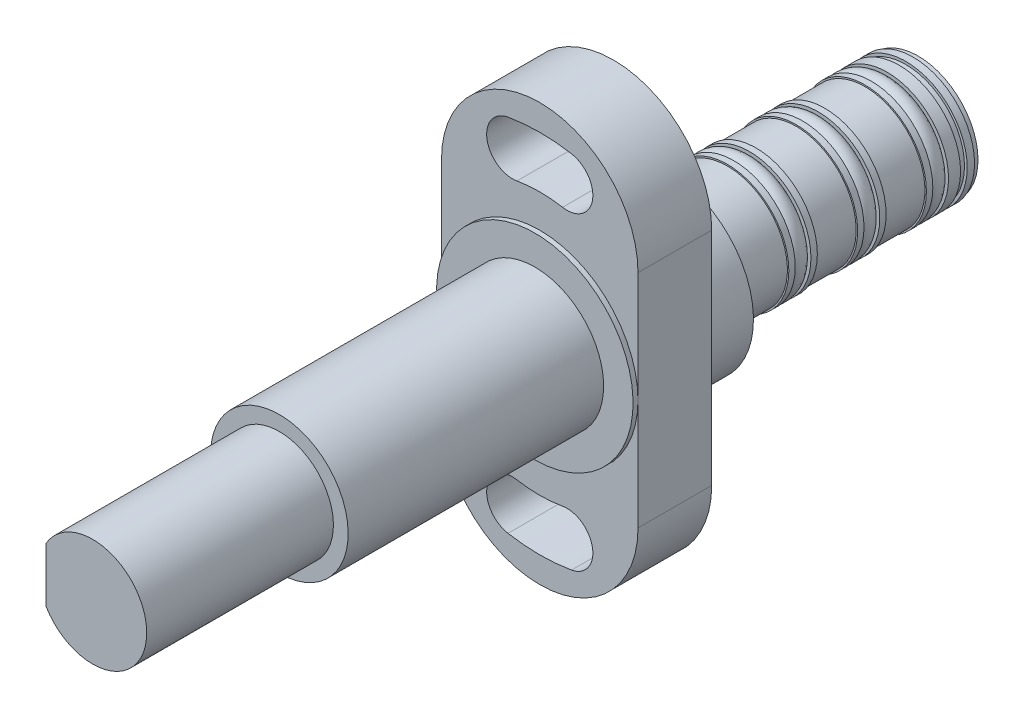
ISO-10303-21;
HEADER;
FILE_DESCRIPTION(('STEP AP214'),'2;1');
FILE_NAME('part.step','',(''),(''),'','','');
FILE_SCHEMA(('AUTOMOTIVE_DESIGN { 1 0 10303 214 1 1 1 1 }'));
ENDSEC;
DATA;
#1=APPLICATION_CONTEXT('core data for automotive mechanical design processes');
#2=APPLICATION_PROTOCOL_DEFINITION('international standard','automotive_design',2000,#1);
#3=PRODUCT_CONTEXT('',#1,'mechanical');
#4=PRODUCT('Part','Part','',(#3));
#5=PRODUCT_RELATED_PRODUCT_CATEGORY('part','',(#4));
#6=PRODUCT_DEFINITION_FORMATION('','',#4);
#7=PRODUCT_DEFINITION_CONTEXT('part definition',#1,'design');
#8=PRODUCT_DEFINITION('design','',#6,#7);
#9=PRODUCT_DEFINITION_SHAPE('','',#8);
#10=(LENGTH_UNIT() NAMED_UNIT(*) SI_UNIT(.MILLI.,.METRE.));
#11=(NAMED_UNIT(*) PLANE_ANGLE_UNIT() SI_UNIT($,.RADIAN.));
#12=(NAMED_UNIT(*) SI_UNIT($,.STERADIAN.) SOLID_ANGLE_UNIT());
#13=UNCERTAINTY_MEASURE_WITH_UNIT(LENGTH_MEASURE(1.E-05),#10,'distance_accuracy_value','');
#14=(GEOMETRIC_REPRESENTATION_CONTEXT(3) GLOBAL_UNCERTAINTY_ASSIGNED_CONTEXT((#13)) GLOBAL_UNIT_ASSIGNED_CONTEXT((#10,
#11,#12)) REPRESENTATION_CONTEXT('',''));
#15=CARTESIAN_POINT('',(0.,0.,0.));
#16=DIRECTION('',(0.,0.,1.));
#17=DIRECTION('',(1.,0.,0.));
#18=AXIS2_PLACEMENT_3D('',#15,#16,#17);
#19=CARTESIAN_POINT('',(0.,0.,-77.));
#20=DIRECTION('',(0.,0.,-1.));
#21=DIRECTION('',(-1.,0.,0.));
#22=AXIS2_PLACEMENT_3D('',#19,#20,#21);
#23=CONICAL_SURFACE('',#22,2.9,0.78539816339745);
#24=CARTESIAN_POINT('',(0.,0.,-76.6));
#25=DIRECTION('',(0.,0.,-1.));
#26=DIRECTION('',(-1.,0.,0.));
#27=AXIS2_PLACEMENT_3D('',#24,#25,#26);
#28=CIRCLE('',#27,2.5);
#29=CARTESIAN_POINT('',(-2.5,0.,-76.6));
#30=VERTEX_POINT('',#29);
#31=EDGE_CURVE('E19',#30,#30,#28,.F.);
#32=ORIENTED_EDGE('',*,*,#31,.T.);
#33=EDGE_LOOP('',(#32));
#34=FACE_BOUND('',#33,.T.);
#35=CARTESIAN_POINT('',(0.,0.,-77.));
#36=DIRECTION('',(0.,0.,-1.));
#37=DIRECTION('',(-1.,0.,0.));
#38=AXIS2_PLACEMENT_3D('',#35,#36,#37);
#39=CIRCLE('',#38,2.9);
#40=CARTESIAN_POINT('',(-2.9,0.,-77.));
#41=VERTEX_POINT('',#40);
#42=EDGE_CURVE('E1242',#41,#41,#39,.T.);
#43=ORIENTED_EDGE('',*,*,#42,.T.);
#44=EDGE_LOOP('',(#43));
#45=FACE_BOUND('',#44,.T.);
#46=ADVANCED_FACE('F15',(#34,#45),#23,.F.);
#47=CARTESIAN_POINT('',(-12.5,0.,-77.));
#48=DIRECTION('',(0.,0.,1.));
#49=DIRECTION('',(1.,0.,0.));
#50=AXIS2_PLACEMENT_3D('',#47,#48,#49);
#51=PLANE('',#50);
#52=ORIENTED_EDGE('',*,*,#42,.F.);
#53=EDGE_LOOP('',(#52));
#54=FACE_BOUND('',#53,.T.);
#55=CARTESIAN_POINT('',(0.,0.,-77.));
#56=DIRECTION('',(0.,0.,1.));
#57=DIRECTION('',(1.,0.,0.));
#58=AXIS2_PLACEMENT_3D('',#55,#56,#57);
#59=CIRCLE('',#58,12.2);
#60=CARTESIAN_POINT('',(12.2,0.,-77.));
#61=VERTEX_POINT('',#60);
#62=EDGE_CURVE('E335',#61,#61,#59,.T.);
#63=ORIENTED_EDGE('',*,*,#62,.F.);
#64=EDGE_LOOP('',(#63));
#65=FACE_BOUND('',#64,.T.);
#66=ADVANCED_FACE('F436',(#54,#65),#51,.F.);
#67=CARTESIAN_POINT('',(0.,0.,-17.5));
#68=DIRECTION('',(0.,0.,-1.));
#69=DIRECTION('',(-1.,0.,0.));
#70=AXIS2_PLACEMENT_3D('',#67,#68,#69);
#71=CYLINDRICAL_SURFACE('',#70,12.2);
#72=CARTESIAN_POINT('',(0.,0.,-76.));
#73=DIRECTION('',(0.,0.,1.));
#74=DIRECTION('',(1.,0.,0.));
#75=AXIS2_PLACEMENT_3D('',#72,#73,#74);
#76=CIRCLE('',#75,12.2);
#77=CARTESIAN_POINT('',(12.2,0.,-76.));
#78=VERTEX_POINT('',#77);
#79=EDGE_CURVE('E363',#78,#78,#76,.T.);
#80=ORIENTED_EDGE('',*,*,#79,.F.);
#81=EDGE_LOOP('',(#80));
#82=FACE_BOUND('',#81,.T.);
#83=ORIENTED_EDGE('',*,*,#62,.T.);
#84=EDGE_LOOP('',(#83));
#85=FACE_BOUND('',#84,.T.);
#86=ADVANCED_FACE('F438',(#82,#85),#71,.T.);
#87=CARTESIAN_POINT('',(-12.2,0.,-76.));
#88=DIRECTION('',(0.,0.,1.));
#89=DIRECTION('',(1.,0.,0.));
#90=AXIS2_PLACEMENT_3D('',#87,#88,#89);
#91=PLANE('',#90);
#92=CARTESIAN_POINT('',(0.,0.,-76.));
#93=DIRECTION('',(0.,0.,1.));
#94=DIRECTION('',(1.,0.,0.));
#95=AXIS2_PLACEMENT_3D('',#92,#93,#94);
#96=CIRCLE('',#95,12.5);
#97=CARTESIAN_POINT('',(12.5,0.,-76.));
#98=VERTEX_POINT('',#97);
#99=EDGE_CURVE('E367',#98,#98,#96,.T.);
#100=ORIENTED_EDGE('',*,*,#99,.F.);
#101=EDGE_LOOP('',(#100));
#102=FACE_BOUND('',#101,.T.);
#103=ORIENTED_EDGE('',*,*,#79,.T.);
#104=EDGE_LOOP('',(#103));
#105=FACE_BOUND('',#104,.T.);
#106=ADVANCED_FACE('F1093',(#102,#105),#91,.F.);
#107=CARTESIAN_POINT('',(0.,0.,-17.5));
#108=DIRECTION('',(0.,0.,1.));
#109=DIRECTION('',(1.,0.,0.));
#110=AXIS2_PLACEMENT_3D('',#107,#108,#109);
#111=CYLINDRICAL_SURFACE('',#110,12.5);
#112=CARTESIAN_POINT('',(0.,0.,-74.5));
#113=DIRECTION('',(0.,0.,1.));
#114=DIRECTION('',(1.,0.,0.));
#115=AXIS2_PLACEMENT_3D('',#112,#113,#114);
#116=CIRCLE('',#115,12.5);
#117=CARTESIAN_POINT('',(12.5,0.,-74.5));
#118=VERTEX_POINT('',#117);
#119=EDGE_CURVE('E1239',#118,#118,#116,.T.);
#120=ORIENTED_EDGE('',*,*,#119,.F.);
#121=EDGE_LOOP('',(#120));
#122=FACE_BOUND('',#121,.T.);
#123=ORIENTED_EDGE('',*,*,#99,.T.);
#124=EDGE_LOOP('',(#123));
#125=FACE_BOUND('',#124,.T.);
#126=ADVANCED_FACE('F984',(#122,#125),#111,.T.);
#127=CARTESIAN_POINT('',(-12.5,0.,-74.5));
#128=DIRECTION('',(0.,0.,1.));
#129=DIRECTION('',(1.,0.,0.));
#130=AXIS2_PLACEMENT_3D('',#127,#128,#129);
#131=PLANE('',#130);
#132=ORIENTED_EDGE('',*,*,#119,.T.);
#133=EDGE_LOOP('',(#132));
#134=FACE_BOUND('',#133,.T.);
#135=CARTESIAN_POINT('',(0.,0.,-74.5));
#136=DIRECTION('',(0.,0.,1.));
#137=DIRECTION('',(1.,0.,0.));
#138=AXIS2_PLACEMENT_3D('',#135,#136,#137);
#139=CIRCLE('',#138,11.95);
#140=CARTESIAN_POINT('',(11.95,0.,-74.5));
#141=VERTEX_POINT('',#140);
#142=EDGE_CURVE('E1235',#141,#141,#139,.T.);
#143=ORIENTED_EDGE('',*,*,#142,.F.);
#144=EDGE_LOOP('',(#143));
#145=FACE_BOUND('',#144,.T.);
#146=ADVANCED_FACE('F468',(#134,#145),#131,.T.);
#147=CARTESIAN_POINT('',(0.,0.,-17.5));
#148=DIRECTION('',(0.,0.,1.));
#149=DIRECTION('',(1.,0.,0.));
#150=AXIS2_PLACEMENT_3D('',#147,#148,#149);
#151=CYLINDRICAL_SURFACE('',#150,11.95);
#152=ORIENTED_EDGE('',*,*,#142,.T.);
#153=EDGE_LOOP('',(#152));
#154=FACE_BOUND('',#153,.T.);
#155=CARTESIAN_POINT('',(0.,0.,-73.15));
#156=DIRECTION('',(0.,0.,1.));
#157=DIRECTION('',(1.,0.,0.));
#158=AXIS2_PLACEMENT_3D('',#155,#156,#157);
#159=CIRCLE('',#158,11.95);
#160=CARTESIAN_POINT('',(11.95,0.,-73.15));
#161=VERTEX_POINT('',#160);
#162=EDGE_CURVE('E1212',#161,#161,#159,.T.);
#163=ORIENTED_EDGE('',*,*,#162,.F.);
#164=EDGE_LOOP('',(#163));
#165=FACE_BOUND('',#164,.T.);
#166=ADVANCED_FACE('F1067',(#154,#165),#151,.T.);
#167=CARTESIAN_POINT('',(-12.5,0.,-73.15));
#168=DIRECTION('',(0.,0.,-1.));
#169=DIRECTION('',(-1.,0.,0.));
#170=AXIS2_PLACEMENT_3D('',#167,#168,#169);
#171=PLANE('',#170);
#172=ORIENTED_EDGE('',*,*,#162,.T.);
#173=EDGE_LOOP('',(#172));
#174=FACE_BOUND('',#173,.T.);
#175=CARTESIAN_POINT('',(0.,0.,-73.15));
#176=DIRECTION('',(0.,0.,1.));
#177=DIRECTION('',(1.,0.,0.));
#178=AXIS2_PLACEMENT_3D('',#175,#176,#177);
#179=CIRCLE('',#178,12.5);
#180=CARTESIAN_POINT('',(12.5,0.,-73.15));
#181=VERTEX_POINT('',#180);
#182=EDGE_CURVE('E1200',#181,#181,#179,.T.);
#183=ORIENTED_EDGE('',*,*,#182,.F.);
#184=EDGE_LOOP('',(#183));
#185=FACE_BOUND('',#184,.T.);
#186=ADVANCED_FACE('F1058',(#174,#185),#171,.T.);
#187=CARTESIAN_POINT('',(0.,0.,-70.7));
#188=DIRECTION('',(0.,0.,1.));
#189=DIRECTION('',(1.,0.,0.));
#190=AXIS2_PLACEMENT_3D('',#187,#188,#189);
#191=CIRCLE('',#190,12.5);
#192=CARTESIAN_POINT('',(12.5,0.,-70.7));
#193=VERTEX_POINT('',#192);
#194=EDGE_CURVE('E1213',#193,#193,#191,.T.);
#195=ORIENTED_EDGE('',*,*,#194,.F.);
#196=EDGE_LOOP('',(#195));
#197=FACE_BOUND('',#196,.T.);
#198=ORIENTED_EDGE('',*,*,#182,.T.);
#199=EDGE_LOOP('',(#198));
#200=FACE_BOUND('',#199,.T.);
#201=ADVANCED_FACE('F434',(#197,#200),#111,.T.);
#202=CARTESIAN_POINT('',(-12.5,0.,-70.7));
#203=DIRECTION('',(0.,0.,1.));
#204=DIRECTION('',(1.,0.,0.));
#205=AXIS2_PLACEMENT_3D('',#202,#203,#204);
#206=PLANE('',#205);
#207=CARTESIAN_POINT('',(0.,0.,-70.7));
#208=DIRECTION('',(0.,0.,-1.));
#209=DIRECTION('',(0.,-1.,0.));
#210=AXIS2_PLACEMENT_3D('',#207,#208,#209);
#211=CIRCLE('',#210,11.5);
#212=CARTESIAN_POINT('',(0.,-11.5,-70.7));
#213=VERTEX_POINT('',#212);
#214=EDGE_CURVE('E9',#213,#213,#211,.T.);
#215=ORIENTED_EDGE('',*,*,#214,.T.);
#216=EDGE_LOOP('',(#215));
#217=FACE_BOUND('',#216,.T.);
#218=ORIENTED_EDGE('',*,*,#194,.T.);
#219=EDGE_LOOP('',(#218));
#220=FACE_BOUND('',#219,.T.);
#221=ADVANCED_FACE('F423',(#217,#220),#206,.T.);
#222=CARTESIAN_POINT('',(0.,0.,-68.5));
#223=DIRECTION('',(0.,0.,1.));
#224=DIRECTION('',(1.,0.,0.));
#225=AXIS2_PLACEMENT_3D('',#222,#223,#224);
#226=CYLINDRICAL_SURFACE('',#225,9.);
#227=CARTESIAN_POINT('',(-9.,0.,-63.25));
#228=CARTESIAN_POINT('',(-8.99999959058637,-0.0420495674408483,-63.2500018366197));
#229=CARTESIAN_POINT('',(-8.99970216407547,-0.0841277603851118,-63.2535482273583));
#230=CARTESIAN_POINT('',(-8.99854426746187,-0.167119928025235,-63.2676432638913));
#231=CARTESIAN_POINT('',(-8.99768315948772,-0.208032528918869,-63.2781998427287));
#232=CARTESIAN_POINT('',(-8.99549520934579,-0.287479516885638,-63.306007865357));
#233=CARTESIAN_POINT('',(-8.99416863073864,-0.326015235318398,-63.3232555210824));
#234=CARTESIAN_POINT('',(-8.99119850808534,-0.399635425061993,-63.363949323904));
#235=CARTESIAN_POINT('',(-8.98955503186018,-0.434720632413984,-63.3873941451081));
#236=CARTESIAN_POINT('',(-8.98613084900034,-0.500542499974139,-63.4398812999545));
#237=CARTESIAN_POINT('',(-8.98434984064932,-0.531269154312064,-63.4689361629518));
#238=CARTESIAN_POINT('',(-8.98085385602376,-0.587415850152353,-63.5317921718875));
#239=CARTESIAN_POINT('',(-8.9791388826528,-0.612835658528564,-63.565593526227));
#240=CARTESIAN_POINT('',(-8.97596589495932,-0.657680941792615,-63.6370435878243));
#241=CARTESIAN_POINT('',(-8.97450825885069,-0.677097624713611,-63.6746978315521));
#242=CARTESIAN_POINT('',(-8.97201843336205,-0.709329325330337,-63.752746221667));
#243=CARTESIAN_POINT('',(-8.97098623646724,-0.722144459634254,-63.7931403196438));
#244=CARTESIAN_POINT('',(-8.96946669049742,-0.74078027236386,-63.875421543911));
#245=CARTESIAN_POINT('',(-8.96897807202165,-0.746617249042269,-63.9173049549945));
#246=CARTESIAN_POINT('',(-8.96859699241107,-0.751181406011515,-64.0014596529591));
#247=CARTESIAN_POINT('',(-8.96870452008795,-0.749908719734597,-64.0437309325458));
#248=CARTESIAN_POINT('',(-8.96950243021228,-0.74030314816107,-64.1273497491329));
#249=CARTESIAN_POINT('',(-8.9701913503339,-0.731987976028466,-64.1686993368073));
#250=CARTESIAN_POINT('',(-8.97207212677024,-0.708560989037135,-64.2494139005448));
#251=CARTESIAN_POINT('',(-8.97326398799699,-0.693449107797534,-64.2887788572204));
#252=CARTESIAN_POINT('',(-8.97601803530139,-0.656837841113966,-64.3644631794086));
#253=CARTESIAN_POINT('',(-8.97758068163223,-0.635330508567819,-64.4007786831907));
#254=CARTESIAN_POINT('',(-8.9808998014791,-0.58654458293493,-64.4692910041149));
#255=CARTESIAN_POINT('',(-8.98265627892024,-0.559265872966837,-64.5014877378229));
#256=CARTESIAN_POINT('',(-8.98617165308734,-0.49961218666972,-64.5609515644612));
#257=CARTESIAN_POINT('',(-8.98793054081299,-0.467221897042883,-64.5882032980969));
#258=CARTESIAN_POINT('',(-8.99124743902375,-0.398317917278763,-64.6368847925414));
#259=CARTESIAN_POINT('',(-8.99280544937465,-0.361804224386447,-64.6583145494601));
#260=CARTESIAN_POINT('',(-8.9955453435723,-0.285679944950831,-64.6947428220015));
#261=CARTESIAN_POINT('',(-8.99672718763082,-0.246069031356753,-64.7097406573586));
#262=CARTESIAN_POINT('',(-8.99858113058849,-0.164879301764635,-64.7328685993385));
#263=CARTESIAN_POINT('',(-8.99925324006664,-0.123300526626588,-64.7409988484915));
#264=CARTESIAN_POINT('',(-9.00001062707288,-0.0394884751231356,-64.7501415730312));
#265=CARTESIAN_POINT('',(-9.00009765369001,0.00274247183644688,-64.7511752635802));
#266=CARTESIAN_POINT('',(-8.99967974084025,0.0867770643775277,-64.7461511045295));
#267=CARTESIAN_POINT('',(-8.99917480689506,0.128580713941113,-64.7400933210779));
#268=CARTESIAN_POINT('',(-8.9976308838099,0.210513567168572,-64.7210757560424));
#269=CARTESIAN_POINT('',(-8.99659265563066,0.25064506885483,-64.7081258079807));
#270=CARTESIAN_POINT('',(-8.99409877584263,0.328165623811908,-64.6757015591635));
#271=CARTESIAN_POINT('',(-8.99264311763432,0.365554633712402,-64.6562271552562));
#272=CARTESIAN_POINT('',(-8.98947319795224,0.436625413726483,-64.6112534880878));
#273=CARTESIAN_POINT('',(-8.98775833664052,0.470298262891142,-64.5857401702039));
#274=CARTESIAN_POINT('',(-8.98426468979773,0.532890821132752,-64.5294332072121));
#275=CARTESIAN_POINT('',(-8.98248590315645,0.561810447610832,-64.498639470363));
#276=CARTESIAN_POINT('',(-8.97905970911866,0.61414840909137,-64.4325537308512));
#277=CARTESIAN_POINT('',(-8.97741263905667,0.637552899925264,-64.397250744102));
#278=CARTESIAN_POINT('',(-8.97444113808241,0.678101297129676,-64.3232033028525));
#279=CARTESIAN_POINT('',(-8.97311670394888,0.695245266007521,-64.2844588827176));
#280=CARTESIAN_POINT('',(-8.97094232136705,0.722762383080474,-64.2046774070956));
#281=CARTESIAN_POINT('',(-8.97009177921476,0.733144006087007,-64.1636432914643));
#282=CARTESIAN_POINT('',(-8.96895949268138,0.746869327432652,-64.0804069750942));
#283=CARTESIAN_POINT('',(-8.96867773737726,0.750213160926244,-64.0382047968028));
#284=CARTESIAN_POINT('',(-8.96871508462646,0.749766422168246,-63.9539679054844));
#285=CARTESIAN_POINT('',(-8.96903235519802,0.745997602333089,-63.9119330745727));
#286=CARTESIAN_POINT('',(-8.9702281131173,0.73147789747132,-63.8290955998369));
#287=CARTESIAN_POINT('',(-8.97110660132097,0.720727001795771,-63.7882929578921));
#288=CARTESIAN_POINT('',(-8.97332532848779,0.692553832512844,-63.70907667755));
#289=CARTESIAN_POINT('',(-8.97466554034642,0.675131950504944,-63.6706628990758));
#290=CARTESIAN_POINT('',(-8.97765674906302,0.634113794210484,-63.5973018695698));
#291=CARTESIAN_POINT('',(-8.97930774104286,0.610517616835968,-63.56235456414));
#292=CARTESIAN_POINT('',(-8.98274048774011,0.55773895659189,-63.4968071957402));
#293=CARTESIAN_POINT('',(-8.98452261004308,0.528540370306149,-63.466220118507));
#294=CARTESIAN_POINT('',(-8.98801346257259,0.465414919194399,-63.4103686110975));
#295=CARTESIAN_POINT('',(-8.98972217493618,0.431486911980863,-63.385105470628));
#296=CARTESIAN_POINT('',(-8.99287676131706,0.359800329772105,-63.3405851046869));
#297=CARTESIAN_POINT('',(-8.99432214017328,0.322034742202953,-63.3213391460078));
#298=CARTESIAN_POINT('',(-8.99678139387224,0.243821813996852,-63.2894861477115));
#299=CARTESIAN_POINT('',(-8.99779576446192,0.203377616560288,-63.2768714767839));
#300=CARTESIAN_POINT('',(-8.99901830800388,0.135579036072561,-63.2618518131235));
#301=CARTESIAN_POINT('',(-8.99938476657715,0.108660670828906,-63.2574132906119));
#302=CARTESIAN_POINT('',(-8.99987574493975,0.0544988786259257,-63.2514867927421));
#303=CARTESIAN_POINT('',(-9.00000026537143,0.0272554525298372,-63.2499988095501));
#304=CARTESIAN_POINT('',(-9.,0.,-63.25));
#305=B_SPLINE_CURVE_WITH_KNOTS('',3,(#227,#228,#229,#230,#231,#232,#233,#234,#235,#236,#237,
#238,#239,#240,#241,#242,#243,#244,#245,#246,#247,#248,#249,#250,#251,#252,#253,#254,#255,#256,
#257,#258,#259,#260,#261,#262,#263,#264,#265,#266,#267,#268,#269,#270,#271,#272,#273,#274,#275,
#276,#277,#278,#279,#280,#281,#282,#283,#284,#285,#286,#287,#288,#289,#290,#291,#292,#293,#294,
#295,#296,#297,#298,#299,#300,#301,#302,#303,#304),.UNSPECIFIED.,.T.,.F.,(4,2,2,2,2,2,2,2,2,2,2,
2,2,2,2,2,2,2,2,2,2,2,2,2,2,2,2,2,2,2,2,2,2,2,2,2,2,2,4),(0.,0.1260491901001,0.25224126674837,
0.378362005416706,0.504455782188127,0.630834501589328,0.757218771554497,0.883787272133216,
1.01035353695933,1.13662361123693,1.26289131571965,1.3888423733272,1.51479466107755,
1.64090411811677,1.76701612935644,1.8935133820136,2.02001071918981,2.14652143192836,
2.273029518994,2.39915924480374,2.52528779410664,2.65123686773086,2.77718793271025,
2.90343506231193,3.02968438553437,3.15624732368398,3.28280899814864,3.4092117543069,
3.53561208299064,3.66162647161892,3.78764105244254,3.9136482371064,4.03965344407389,
4.16602641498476,4.29242996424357,4.41906879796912,4.54556157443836,4.62726364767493,
4.70896550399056),.UNSPECIFIED.);
#306=CARTESIAN_POINT('',(-9.,0.,-63.25));
#307=VERTEX_POINT('',#306);
#308=EDGE_CURVE('E408',#307,#307,#305,.T.);
#309=ORIENTED_EDGE('',*,*,#308,.F.);
#310=EDGE_LOOP('',(#309));
#311=FACE_BOUND('',#310,.T.);
#312=ADVANCED_FACE('F417',(#311),#226,.T.);
#313=CARTESIAN_POINT('',(11.5,0.,-69.1));
#314=DIRECTION('',(0.,1.,0.));
#315=DIRECTION('',(0.,0.,-1.));
#316=AXIS2_PLACEMENT_3D('',#313,#314,#315);
#317=ELLIPSE('',#316,1.6,1.);
#318=CARTESIAN_POINT('',(0.,0.,-70.7));
#319=DIRECTION('',(0.,0.,-1.));
#320=AXIS1_PLACEMENT('',#318,#319);
#321=SURFACE_OF_REVOLUTION('',#317,#320);
#322=CARTESIAN_POINT('',(0.,0.,-67.5));
#323=DIRECTION('',(0.,0.,-1.));
#324=DIRECTION('',(0.,-1.,0.));
#325=AXIS2_PLACEMENT_3D('',#322,#323,#324);
#326=CIRCLE('',#325,11.5);
#327=CARTESIAN_POINT('',(0.,-11.5,-67.5));
#328=VERTEX_POINT('',#327);
#329=EDGE_CURVE('E25',#328,#328,#326,.F.);
#330=ORIENTED_EDGE('',*,*,#329,.F.);
#331=EDGE_LOOP('',(#330));
#332=FACE_BOUND('',#331,.T.);
#333=ORIENTED_EDGE('',*,*,#214,.F.);
#334=EDGE_LOOP('',(#333));
#335=FACE_BOUND('',#334,.T.);
#336=ADVANCED_FACE('F422',(#332,#335),#321,.T.);
#337=CARTESIAN_POINT('',(-12.5,0.,-64.));
#338=DIRECTION('',(-1.,0.,0.));
#339=DIRECTION('',(0.,0.,1.));
#340=AXIS2_PLACEMENT_3D('',#337,#338,#339);
#341=CYLINDRICAL_SURFACE('',#340,0.749999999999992);
#342=ORIENTED_EDGE('',*,*,#308,.T.);
#343=EDGE_LOOP('',(#342));
#344=FACE_BOUND('',#343,.T.);
#345=CARTESIAN_POINT('',(-9.04935453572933,0.,-64.));
#346=DIRECTION('',(-1.,0.,0.));
#347=DIRECTION('',(0.,0.,1.));
#348=AXIS2_PLACEMENT_3D('',#345,#346,#347);
#349=CIRCLE('',#348,0.749999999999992);
#350=CARTESIAN_POINT('',(-9.04935453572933,0.,-63.25));
#351=VERTEX_POINT('',#350);
#352=EDGE_CURVE('E1181',#351,#351,#349,.T.);
#353=ORIENTED_EDGE('',*,*,#352,.T.);
#354=EDGE_LOOP('',(#353));
#355=FACE_BOUND('',#354,.T.);
#356=ADVANCED_FACE('F440',(#344,#355),#341,.F.);
#357=CARTESIAN_POINT('',(-12.5,0.,-67.5));
#358=DIRECTION('',(0.,0.,-1.));
#359=DIRECTION('',(-1.,0.,0.));
#360=AXIS2_PLACEMENT_3D('',#357,#358,#359);
#361=PLANE('',#360);
#362=CARTESIAN_POINT('',(0.,0.,-67.5));
#363=DIRECTION('',(0.,0.,1.));
#364=DIRECTION('',(1.,0.,0.));
#365=AXIS2_PLACEMENT_3D('',#362,#363,#364);
#366=CIRCLE('',#365,12.5);
#367=CARTESIAN_POINT('',(12.5,0.,-67.5));
#368=VERTEX_POINT('',#367);
#369=EDGE_CURVE('E1208',#368,#368,#366,.T.);
#370=ORIENTED_EDGE('',*,*,#369,.F.);
#371=EDGE_LOOP('',(#370));
#372=FACE_BOUND('',#371,.T.);
#373=ORIENTED_EDGE('',*,*,#329,.T.);
#374=EDGE_LOOP('',(#373));
#375=FACE_BOUND('',#374,.T.);
#376=ADVANCED_FACE('F443',(#372,#375),#361,.T.);
#377=CARTESIAN_POINT('',(-9.5,0.,-64.));
#378=DIRECTION('',(-1.,0.,0.));
#379=DIRECTION('',(0.,0.,1.));
#380=AXIS2_PLACEMENT_3D('',#377,#378,#379);
#381=CONICAL_SURFACE('',#380,1.5,1.02974425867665);
#382=CARTESIAN_POINT('',(-9.5,0.,-64.));
#383=DIRECTION('',(-1.,0.,0.));
#384=DIRECTION('',(0.,0.,1.));
#385=AXIS2_PLACEMENT_3D('',#382,#383,#384);
#386=CIRCLE('',#385,1.5);
#387=CARTESIAN_POINT('',(-9.5,0.,-62.5));
#388=VERTEX_POINT('',#387);
#389=EDGE_CURVE('E1166',#388,#388,#386,.T.);
#390=ORIENTED_EDGE('',*,*,#389,.T.);
#391=EDGE_LOOP('',(#390));
#392=FACE_BOUND('',#391,.T.);
#393=ORIENTED_EDGE('',*,*,#352,.F.);
#394=EDGE_LOOP('',(#393));
#395=FACE_BOUND('',#394,.T.);
#396=ADVANCED_FACE('F451',(#392,#395),#381,.F.);
#397=ORIENTED_EDGE('',*,*,#369,.T.);
#398=EDGE_LOOP('',(#397));
#399=FACE_BOUND('',#398,.T.);
#400=CARTESIAN_POINT('',(0.,0.,-66.2));
#401=DIRECTION('',(0.,0.,1.));
#402=DIRECTION('',(1.,0.,0.));
#403=AXIS2_PLACEMENT_3D('',#400,#401,#402);
#404=CIRCLE('',#403,12.5);
#405=CARTESIAN_POINT('',(12.5,0.,-66.2));
#406=VERTEX_POINT('',#405);
#407=EDGE_CURVE('E371',#406,#406,#404,.T.);
#408=ORIENTED_EDGE('',*,*,#407,.F.);
#409=EDGE_LOOP('',(#408));
#410=FACE_BOUND('',#409,.T.);
#411=ADVANCED_FACE('F873',(#399,#410),#111,.T.);
#412=CARTESIAN_POINT('',(-12.5,0.,-64.));
#413=DIRECTION('',(-1.,0.,0.));
#414=DIRECTION('',(0.,0.,1.));
#415=AXIS2_PLACEMENT_3D('',#412,#413,#414);
#416=CYLINDRICAL_SURFACE('',#415,1.5);
#417=CARTESIAN_POINT('',(-12.2,0.,-62.5));
#418=CARTESIAN_POINT('',(-12.1999988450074,0.0839160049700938,-62.5000035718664));
#419=CARTESIAN_POINT('',(-12.1991250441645,0.167884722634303,-62.5070656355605));
#420=CARTESIAN_POINT('',(-12.1957233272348,0.333486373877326,-62.5351265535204));
#421=CARTESIAN_POINT('',(-12.1931936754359,0.41511676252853,-62.5561400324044));
#422=CARTESIAN_POINT('',(-12.1867652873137,0.573620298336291,-62.6114759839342));
#423=CARTESIAN_POINT('',(-12.1828674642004,0.650496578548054,-62.6457895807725));
#424=CARTESIAN_POINT('',(-12.1741364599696,0.797384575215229,-62.7267325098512));
#425=CARTESIAN_POINT('',(-12.1693034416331,0.867397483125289,-62.7733596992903));
#426=CARTESIAN_POINT('',(-12.1592129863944,0.99895955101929,-62.8778722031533));
#427=CARTESIAN_POINT('',(-12.1539536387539,1.06046683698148,-62.9358100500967));
#428=CARTESIAN_POINT('',(-12.1436187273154,1.17291112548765,-63.0611864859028));
#429=CARTESIAN_POINT('',(-12.1385431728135,1.22384759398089,-63.1286255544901));
#430=CARTESIAN_POINT('',(-12.1291316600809,1.31385969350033,-63.2713613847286));
#431=CARTESIAN_POINT('',(-12.1247981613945,1.35289620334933,-63.3466829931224));
#432=CARTESIAN_POINT('',(-12.1173864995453,1.41775044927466,-63.5028748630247));
#433=CARTESIAN_POINT('',(-12.1143082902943,1.44356867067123,-63.5837449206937));
#434=CARTESIAN_POINT('',(-12.1097739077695,1.481126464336,-63.7483040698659));
#435=CARTESIAN_POINT('',(-12.1083096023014,1.49293664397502,-63.8319768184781));
#436=CARTESIAN_POINT('',(-12.1071439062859,1.50236156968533,-64.0001285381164));
#437=CARTESIAN_POINT('',(-12.107442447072,1.49997686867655,-64.0846074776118));
#438=CARTESIAN_POINT('',(-12.1097612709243,1.48113770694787,-64.2514819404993));
#439=CARTESIAN_POINT('',(-12.1117720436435,1.46476096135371,-64.3338863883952));
#440=CARTESIAN_POINT('',(-12.1172739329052,1.41852381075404,-64.4947684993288));
#441=CARTESIAN_POINT('',(-12.1207650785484,1.38866314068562,-64.5732460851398));
#442=CARTESIAN_POINT('',(-12.1288451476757,1.31622204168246,-64.7242885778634));
#443=CARTESIAN_POINT('',(-12.1334369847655,1.2736077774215,-64.7968370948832));
#444=CARTESIAN_POINT('',(-12.1431987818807,1.17689336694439,-64.9337824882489));
#445=CARTESIAN_POINT('',(-12.1483687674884,1.1227927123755,-64.9981790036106));
#446=CARTESIAN_POINT('',(-12.1587466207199,1.00421023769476,-65.1174435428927));
#447=CARTESIAN_POINT('',(-12.1639545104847,0.939661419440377,-65.1722449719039));
#448=CARTESIAN_POINT('',(-12.1737890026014,0.802245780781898,-65.2702454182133));
#449=CARTESIAN_POINT('',(-12.178415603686,0.729378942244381,-65.3134444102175));
#450=CARTESIAN_POINT('',(-12.1865689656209,0.577344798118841,-65.387013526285));
#451=CARTESIAN_POINT('',(-12.1900953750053,0.49817548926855,-65.4173795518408));
#452=CARTESIAN_POINT('',(-12.1956478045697,0.335808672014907,-65.4643682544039));
#453=CARTESIAN_POINT('',(-12.1976738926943,0.252611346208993,-65.4809915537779));
#454=CARTESIAN_POINT('',(-12.1999885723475,0.0851260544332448,-65.499936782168));
#455=CARTESIAN_POINT('',(-12.20028831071,0.000848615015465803,-65.5023504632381));
#456=CARTESIAN_POINT('',(-12.1991465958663,-0.166909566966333,-65.4930499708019));
#457=CARTESIAN_POINT('',(-12.1977051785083,-0.250390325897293,-65.4813360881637));
#458=CARTESIAN_POINT('',(-12.1932500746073,-0.413915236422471,-65.4441891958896));
#459=CARTESIAN_POINT('',(-12.1902413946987,-0.493969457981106,-65.4187998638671));
#460=CARTESIAN_POINT('',(-12.1829886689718,-0.648683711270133,-65.3550681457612));
#461=CARTESIAN_POINT('',(-12.1787445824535,-0.723343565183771,-65.3167253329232));
#462=CARTESIAN_POINT('',(-12.1694665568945,-0.865559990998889,-65.2279525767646));
#463=CARTESIAN_POINT('',(-12.164428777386,-0.933079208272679,-65.1774631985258));
#464=CARTESIAN_POINT('',(-12.1541391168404,-1.05871786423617,-65.0659147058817));
#465=CARTESIAN_POINT('',(-12.1488872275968,-1.11683694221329,-65.0048551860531));
#466=CARTESIAN_POINT('',(-12.1387269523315,-1.22235044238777,-64.8734958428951));
#467=CARTESIAN_POINT('',(-12.1338206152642,-1.26968409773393,-64.8031470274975));
#468=CARTESIAN_POINT('',(-12.1249404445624,-1.35186350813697,-64.6554441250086));
#469=CARTESIAN_POINT('',(-12.1209665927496,-1.38670950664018,-64.5780901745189));
#470=CARTESIAN_POINT('',(-12.1144151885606,-1.44282577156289,-64.4187699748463));
#471=CARTESIAN_POINT('',(-12.1118340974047,-1.46413046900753,-64.3368160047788));
#472=CARTESIAN_POINT('',(-12.1083502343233,-1.49267032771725,-64.170460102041));
#473=CARTESIAN_POINT('',(-12.1074473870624,-1.49990612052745,-64.0860582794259));
#474=CARTESIAN_POINT('',(-12.1074243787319,-1.50009144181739,-63.9178070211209));
#475=CARTESIAN_POINT('',(-12.1082923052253,-1.49313643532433,-63.8339576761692));
#476=CARTESIAN_POINT('',(-12.111687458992,-1.46533956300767,-63.6686292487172));
#477=CARTESIAN_POINT('',(-12.1142146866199,-1.44449769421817,-63.5871501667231));
#478=CARTESIAN_POINT('',(-12.1206400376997,-1.38954826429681,-63.4288866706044));
#479=CARTESIAN_POINT('',(-12.1245377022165,-1.35544514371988,-63.3521006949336));
#480=CARTESIAN_POINT('',(-12.1332655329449,-1.2749506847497,-63.2053259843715));
#481=CARTESIAN_POINT('',(-12.1380957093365,-1.22855921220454,-63.1353373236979));
#482=CARTESIAN_POINT('',(-12.1481832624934,-1.12445028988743,-63.0036558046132));
#483=CARTESIAN_POINT('',(-12.153443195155,-1.06666167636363,-62.9420194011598));
#484=CARTESIAN_POINT('',(-12.1637749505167,-0.941546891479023,-62.8292817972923));
#485=CARTESIAN_POINT('',(-12.1688467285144,-0.874218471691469,-62.7781830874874));
#486=CARTESIAN_POINT('',(-12.1782512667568,-0.731651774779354,-62.6878120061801));
#487=CARTESIAN_POINT('',(-12.1825812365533,-0.656385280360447,-62.6485838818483));
#488=CARTESIAN_POINT('',(-12.18998586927,-0.500322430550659,-62.5833793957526));
#489=CARTESIAN_POINT('',(-12.1930619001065,-0.419532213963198,-62.5573885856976));
#490=CARTESIAN_POINT('',(-12.1968677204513,-0.281933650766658,-62.5256413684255));
#491=CARTESIAN_POINT('',(-12.1980366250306,-0.225994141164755,-62.5160396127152));
#492=CARTESIAN_POINT('',(-12.1996031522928,-0.113377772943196,-62.5032177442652));
#493=CARTESIAN_POINT('',(-12.200000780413,-0.0567009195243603,-62.4999975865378));
#494=CARTESIAN_POINT('',(-12.2,0.,-62.5));
#495=B_SPLINE_CURVE_WITH_KNOTS('',3,(#417,#418,#419,#420,#421,#422,#423,#424,#425,#426,#427,
#428,#429,#430,#431,#432,#433,#434,#435,#436,#437,#438,#439,#440,#441,#442,#443,#444,#445,#446,
#447,#448,#449,#450,#451,#452,#453,#454,#455,#456,#457,#458,#459,#460,#461,#462,#463,#464,#465,
#466,#467,#468,#469,#470,#471,#472,#473,#474,#475,#476,#477,#478,#479,#480,#481,#482,#483,#484,
#485,#486,#487,#488,#489,#490,#491,#492,#493,#494),.UNSPECIFIED.,.T.,.F.,(4,2,2,2,2,2,2,2,2,2,2,
2,2,2,2,2,2,2,2,2,2,2,2,2,2,2,2,2,2,2,2,2,2,2,2,2,2,2,4),(0.,0.251540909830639,
0.503345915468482,0.75498316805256,1.00657665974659,1.2593677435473,1.51217159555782,
1.76579779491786,2.01941468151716,2.27174770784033,2.52407090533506,2.77500168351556,
3.02593739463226,3.2775448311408,3.52916340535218,3.78246451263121,4.03576617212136,
4.28914866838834,4.54251968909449,4.79425287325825,5.0459808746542,5.29690961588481,
5.5478466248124,5.80003741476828,6.05223787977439,6.30582596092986,6.55940909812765,
6.8123448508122,7.06526924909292,7.31649777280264,7.56772635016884,7.81887087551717,
8.07001814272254,8.3227862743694,8.57561408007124,8.82937300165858,9.08285435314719,
9.2528183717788,9.42278119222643),.UNSPECIFIED.);
#496=CARTESIAN_POINT('',(-12.2,0.,-62.5));
#497=VERTEX_POINT('',#496);
#498=EDGE_CURVE('E1158',#497,#497,#495,.T.);
#499=ORIENTED_EDGE('',*,*,#498,.T.);
#500=EDGE_LOOP('',(#499));
#501=FACE_BOUND('',#500,.T.);
#502=ORIENTED_EDGE('',*,*,#389,.F.);
#503=EDGE_LOOP('',(#502));
#504=FACE_BOUND('',#503,.T.);
#505=ADVANCED_FACE('F1012',(#501,#504),#416,.F.);
#506=CARTESIAN_POINT('',(-12.5,0.,-66.2));
#507=DIRECTION('',(0.,0.,-1.));
#508=DIRECTION('',(-1.,0.,0.));
#509=AXIS2_PLACEMENT_3D('',#506,#507,#508);
#510=PLANE('',#509);
#511=CARTESIAN_POINT('',(0.,0.,-66.2));
#512=DIRECTION('',(0.,0.,-1.));
#513=DIRECTION('',(-1.,0.,0.));
#514=AXIS2_PLACEMENT_3D('',#511,#512,#513);
#515=CIRCLE('',#514,12.2);
#516=CARTESIAN_POINT('',(-12.2,0.,-66.2));
#517=VERTEX_POINT('',#516);
#518=EDGE_CURVE('E1217',#517,#517,#515,.T.);
#519=ORIENTED_EDGE('',*,*,#518,.T.);
#520=EDGE_LOOP('',(#519));
#521=FACE_BOUND('',#520,.T.);
#522=ORIENTED_EDGE('',*,*,#407,.T.);
#523=EDGE_LOOP('',(#522));
#524=FACE_BOUND('',#523,.T.);
#525=ADVANCED_FACE('F1002',(#521,#524),#510,.F.);
#526=CARTESIAN_POINT('',(0.,0.,-17.5));
#527=DIRECTION('',(0.,0.,-1.));
#528=DIRECTION('',(-1.,0.,0.));
#529=AXIS2_PLACEMENT_3D('',#526,#527,#528);
#530=CYLINDRICAL_SURFACE('',#529,12.2);
#531=CARTESIAN_POINT('',(0.,0.,-58.));
#532=DIRECTION('',(0.,0.,1.));
#533=DIRECTION('',(1.,0.,0.));
#534=AXIS2_PLACEMENT_3D('',#531,#532,#533);
#535=CIRCLE('',#534,12.2);
#536=CARTESIAN_POINT('',(12.2,0.,-58.));
#537=VERTEX_POINT('',#536);
#538=EDGE_CURVE('E375',#537,#537,#535,.T.);
#539=ORIENTED_EDGE('',*,*,#538,.F.);
#540=EDGE_LOOP('',(#539));
#541=FACE_BOUND('',#540,.T.);
#542=ORIENTED_EDGE('',*,*,#518,.F.);
#543=EDGE_LOOP('',(#542));
#544=FACE_BOUND('',#543,.T.);
#545=ORIENTED_EDGE('',*,*,#498,.F.);
#546=EDGE_LOOP('',(#545));
#547=FACE_BOUND('',#546,.T.);
#548=ADVANCED_FACE('F992',(#541,#544,#547),#530,.T.);
#549=CARTESIAN_POINT('',(-12.2,0.,-58.));
#550=DIRECTION('',(0.,0.,1.));
#551=DIRECTION('',(1.,0.,0.));
#552=AXIS2_PLACEMENT_3D('',#549,#550,#551);
#553=PLANE('',#552);
#554=CARTESIAN_POINT('',(0.,0.,-58.));
#555=DIRECTION('',(0.,0.,1.));
#556=DIRECTION('',(1.,0.,0.));
#557=AXIS2_PLACEMENT_3D('',#554,#555,#556);
#558=CIRCLE('',#557,12.5);
#559=CARTESIAN_POINT('',(12.5,0.,-58.));
#560=VERTEX_POINT('',#559);
#561=EDGE_CURVE('E379',#560,#560,#558,.T.);
#562=ORIENTED_EDGE('',*,*,#561,.F.);
#563=EDGE_LOOP('',(#562));
#564=FACE_BOUND('',#563,.T.);
#565=ORIENTED_EDGE('',*,*,#538,.T.);
#566=EDGE_LOOP('',(#565));
#567=FACE_BOUND('',#566,.T.);
#568=ADVANCED_FACE('F982',(#564,#567),#553,.F.);
#569=CARTESIAN_POINT('',(0.,0.,-56.7));
#570=DIRECTION('',(0.,0.,1.));
#571=DIRECTION('',(1.,0.,0.));
#572=AXIS2_PLACEMENT_3D('',#569,#570,#571);
#573=CIRCLE('',#572,12.5);
#574=CARTESIAN_POINT('',(12.5,0.,-56.7));
#575=VERTEX_POINT('',#574);
#576=EDGE_CURVE('E1201',#575,#575,#573,.T.);
#577=ORIENTED_EDGE('',*,*,#576,.F.);
#578=EDGE_LOOP('',(#577));
#579=FACE_BOUND('',#578,.T.);
#580=ORIENTED_EDGE('',*,*,#561,.T.);
#581=EDGE_LOOP('',(#580));
#582=FACE_BOUND('',#581,.T.);
#583=ADVANCED_FACE('F874',(#579,#582),#111,.T.);
#584=CARTESIAN_POINT('',(-12.5,0.,-56.7));
#585=DIRECTION('',(0.,0.,1.));
#586=DIRECTION('',(1.,0.,0.));
#587=AXIS2_PLACEMENT_3D('',#584,#585,#586);
#588=PLANE('',#587);
#589=CARTESIAN_POINT('',(0.,0.,-56.7));
#590=DIRECTION('',(0.,0.,-1.));
#591=DIRECTION('',(0.,-1.,0.));
#592=AXIS2_PLACEMENT_3D('',#589,#590,#591);
#593=CIRCLE('',#592,11.5);
#594=CARTESIAN_POINT('',(0.,-11.5,-56.7));
#595=VERTEX_POINT('',#594);
#596=EDGE_CURVE('E490',#595,#595,#593,.T.);
#597=ORIENTED_EDGE('',*,*,#596,.T.);
#598=EDGE_LOOP('',(#597));
#599=FACE_BOUND('',#598,.T.);
#600=ORIENTED_EDGE('',*,*,#576,.T.);
#601=EDGE_LOOP('',(#600));
#602=FACE_BOUND('',#601,.T.);
#603=ADVANCED_FACE('F964',(#599,#602),#588,.T.);
#604=CARTESIAN_POINT('',(-9.,0.,-45.25));
#605=CARTESIAN_POINT('',(-8.99999959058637,-0.0420495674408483,-45.2500018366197));
#606=CARTESIAN_POINT('',(-8.99970216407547,-0.0841277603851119,-45.2535482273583));
#607=CARTESIAN_POINT('',(-8.99854426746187,-0.167119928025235,-45.2676432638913));
#608=CARTESIAN_POINT('',(-8.99768315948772,-0.208032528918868,-45.2781998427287));
#609=CARTESIAN_POINT('',(-8.99549520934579,-0.287479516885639,-45.306007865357));
#610=CARTESIAN_POINT('',(-8.99416863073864,-0.326015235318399,-45.3232555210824));
#611=CARTESIAN_POINT('',(-8.99119850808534,-0.399635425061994,-45.363949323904));
#612=CARTESIAN_POINT('',(-8.98955503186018,-0.434720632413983,-45.3873941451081));
#613=CARTESIAN_POINT('',(-8.98613084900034,-0.500542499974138,-45.4398812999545));
#614=CARTESIAN_POINT('',(-8.98434984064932,-0.531269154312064,-45.4689361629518));
#615=CARTESIAN_POINT('',(-8.98085385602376,-0.587415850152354,-45.5317921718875));
#616=CARTESIAN_POINT('',(-8.9791388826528,-0.612835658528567,-45.565593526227));
#617=CARTESIAN_POINT('',(-8.97596589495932,-0.657680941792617,-45.6370435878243));
#618=CARTESIAN_POINT('',(-8.97450825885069,-0.677097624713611,-45.6746978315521));
#619=CARTESIAN_POINT('',(-8.97201843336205,-0.709329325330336,-45.752746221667));
#620=CARTESIAN_POINT('',(-8.97098623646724,-0.722144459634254,-45.7931403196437));
#621=CARTESIAN_POINT('',(-8.96946669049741,-0.740780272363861,-45.875421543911));
#622=CARTESIAN_POINT('',(-8.96897807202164,-0.746617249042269,-45.9173049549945));
#623=CARTESIAN_POINT('',(-8.96859699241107,-0.751181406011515,-46.0014596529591));
#624=CARTESIAN_POINT('',(-8.96870452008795,-0.749908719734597,-46.0437309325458));
#625=CARTESIAN_POINT('',(-8.96950243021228,-0.74030314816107,-46.1273497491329));
#626=CARTESIAN_POINT('',(-8.9701913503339,-0.731987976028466,-46.1686993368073));
#627=CARTESIAN_POINT('',(-8.97207212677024,-0.708560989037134,-46.2494139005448));
#628=CARTESIAN_POINT('',(-8.97326398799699,-0.693449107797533,-46.2887788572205));
#629=CARTESIAN_POINT('',(-8.97601803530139,-0.656837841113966,-46.3644631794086));
#630=CARTESIAN_POINT('',(-8.97758068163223,-0.635330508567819,-46.4007786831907));
#631=CARTESIAN_POINT('',(-8.9808998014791,-0.586544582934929,-46.4692910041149));
#632=CARTESIAN_POINT('',(-8.98265627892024,-0.559265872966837,-46.5014877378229));
#633=CARTESIAN_POINT('',(-8.98617165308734,-0.499612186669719,-46.5609515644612));
#634=CARTESIAN_POINT('',(-8.98793054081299,-0.46722189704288,-46.5882032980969));
#635=CARTESIAN_POINT('',(-8.99124743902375,-0.39831791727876,-46.6368847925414));
#636=CARTESIAN_POINT('',(-8.99280544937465,-0.361804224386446,-46.6583145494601));
#637=CARTESIAN_POINT('',(-8.9955453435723,-0.28567994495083,-46.6947428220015));
#638=CARTESIAN_POINT('',(-8.99672718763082,-0.246069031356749,-46.7097406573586));
#639=CARTESIAN_POINT('',(-8.99858113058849,-0.164879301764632,-46.7328685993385));
#640=CARTESIAN_POINT('',(-8.99925324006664,-0.123300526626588,-46.7409988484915));
#641=CARTESIAN_POINT('',(-9.00001062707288,-0.0394884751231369,-46.7501415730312));
#642=CARTESIAN_POINT('',(-9.00009765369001,0.00274247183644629,-46.7511752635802));
#643=CARTESIAN_POINT('',(-8.99967974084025,0.0867770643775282,-46.7461511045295));
#644=CARTESIAN_POINT('',(-8.99917480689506,0.128580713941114,-46.7400933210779));
#645=CARTESIAN_POINT('',(-8.9976308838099,0.210513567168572,-46.7210757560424));
#646=CARTESIAN_POINT('',(-8.99659265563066,0.25064506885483,-46.7081258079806));
#647=CARTESIAN_POINT('',(-8.99409877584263,0.328165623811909,-46.6757015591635));
#648=CARTESIAN_POINT('',(-8.99264311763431,0.365554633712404,-46.6562271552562));
#649=CARTESIAN_POINT('',(-8.98947319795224,0.436625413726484,-46.6112534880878));
#650=CARTESIAN_POINT('',(-8.98775833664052,0.470298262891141,-46.5857401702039));
#651=CARTESIAN_POINT('',(-8.98426468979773,0.53289082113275,-46.5294332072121));
#652=CARTESIAN_POINT('',(-8.98248590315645,0.561810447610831,-46.498639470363));
#653=CARTESIAN_POINT('',(-8.97905970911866,0.61414840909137,-46.4325537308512));
#654=CARTESIAN_POINT('',(-8.97741263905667,0.637552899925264,-46.397250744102));
#655=CARTESIAN_POINT('',(-8.97444113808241,0.678101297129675,-46.3232033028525));
#656=CARTESIAN_POINT('',(-8.97311670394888,0.69524526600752,-46.2844588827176));
#657=CARTESIAN_POINT('',(-8.97094232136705,0.722762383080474,-46.2046774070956));
#658=CARTESIAN_POINT('',(-8.97009177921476,0.733144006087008,-46.1636432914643));
#659=CARTESIAN_POINT('',(-8.96895949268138,0.746869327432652,-46.0804069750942));
#660=CARTESIAN_POINT('',(-8.96867773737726,0.750213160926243,-46.0382047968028));
#661=CARTESIAN_POINT('',(-8.96871508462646,0.749766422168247,-45.9539679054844));
#662=CARTESIAN_POINT('',(-8.96903235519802,0.745997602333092,-45.9119330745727));
#663=CARTESIAN_POINT('',(-8.9702281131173,0.73147789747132,-45.8290955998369));
#664=CARTESIAN_POINT('',(-8.97110660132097,0.720727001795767,-45.7882929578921));
#665=CARTESIAN_POINT('',(-8.97332532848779,0.692553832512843,-45.70907667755));
#666=CARTESIAN_POINT('',(-8.97466554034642,0.675131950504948,-45.6706628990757));
#667=CARTESIAN_POINT('',(-8.97765674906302,0.634113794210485,-45.5973018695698));
#668=CARTESIAN_POINT('',(-8.97930774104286,0.610517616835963,-45.56235456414));
#669=CARTESIAN_POINT('',(-8.98274048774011,0.557738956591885,-45.4968071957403));
#670=CARTESIAN_POINT('',(-8.98452261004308,0.528540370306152,-45.466220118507));
#671=CARTESIAN_POINT('',(-8.98801346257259,0.465414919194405,-45.4103686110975));
#672=CARTESIAN_POINT('',(-8.98972217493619,0.431486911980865,-45.385105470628));
#673=CARTESIAN_POINT('',(-8.99287676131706,0.359800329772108,-45.3405851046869));
#674=CARTESIAN_POINT('',(-8.99432214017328,0.322034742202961,-45.3213391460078));
#675=CARTESIAN_POINT('',(-8.99678139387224,0.243821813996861,-45.2894861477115));
#676=CARTESIAN_POINT('',(-8.99779576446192,0.203377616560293,-45.2768714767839));
#677=CARTESIAN_POINT('',(-8.99901830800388,0.135579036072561,-45.2618518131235));
#678=CARTESIAN_POINT('',(-8.99938476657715,0.108660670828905,-45.2574132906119));
#679=CARTESIAN_POINT('',(-8.99987574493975,0.0544988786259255,-45.2514867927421));
#680=CARTESIAN_POINT('',(-9.00000026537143,0.0272554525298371,-45.2499988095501));
#681=CARTESIAN_POINT('',(-9.,0.,-45.25));
#682=B_SPLINE_CURVE_WITH_KNOTS('',3,(#604,#605,#606,#607,#608,#609,#610,#611,#612,#613,#614,
#615,#616,#617,#618,#619,#620,#621,#622,#623,#624,#625,#626,#627,#628,#629,#630,#631,#632,#633,
#634,#635,#636,#637,#638,#639,#640,#641,#642,#643,#644,#645,#646,#647,#648,#649,#650,#651,#652,
#653,#654,#655,#656,#657,#658,#659,#660,#661,#662,#663,#664,#665,#666,#667,#668,#669,#670,#671,
#672,#673,#674,#675,#676,#677,#678,#679,#680,#681),.UNSPECIFIED.,.T.,.F.,(4,2,2,2,2,2,2,2,2,2,2,
2,2,2,2,2,2,2,2,2,2,2,2,2,2,2,2,2,2,2,2,2,2,2,2,2,2,2,4),(0.,0.126049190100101,
0.252241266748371,0.378362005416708,0.504455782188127,0.630834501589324,0.757218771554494,
0.883787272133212,1.01035353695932,1.13662361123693,1.26289131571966,1.3888423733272,
1.51479466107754,1.64090411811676,1.76701612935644,1.8935133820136,2.02001071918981,
2.14652143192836,2.273029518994,2.39915924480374,2.52528779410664,2.65123686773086,
2.77718793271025,2.90343506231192,3.02968438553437,3.15624732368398,3.28280899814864,
3.4092117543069,3.53561208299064,3.66162647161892,3.78764105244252,3.91364823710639,
4.0396534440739,4.16602641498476,4.29242996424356,4.41906879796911,4.54556157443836,
4.62726364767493,4.70896550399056),.UNSPECIFIED.);
#683=CARTESIAN_POINT('',(-9.,0.,-45.25));
#684=VERTEX_POINT('',#683);
#685=EDGE_CURVE('E399',#684,#684,#682,.T.);
#686=ORIENTED_EDGE('',*,*,#685,.F.);
#687=EDGE_LOOP('',(#686));
#688=FACE_BOUND('',#687,.T.);
#689=ADVANCED_FACE('F425',(#688),#226,.T.);
#690=CARTESIAN_POINT('',(11.5,0.,-55.1));
#691=DIRECTION('',(0.,1.,0.));
#692=DIRECTION('',(0.,0.,-1.));
#693=AXIS2_PLACEMENT_3D('',#690,#691,#692);
#694=ELLIPSE('',#693,1.6,1.);
#695=CARTESIAN_POINT('',(0.,0.,-56.7));
#696=DIRECTION('',(0.,0.,-1.));
#697=AXIS1_PLACEMENT('',#695,#696);
#698=SURFACE_OF_REVOLUTION('',#694,#697);
#699=CARTESIAN_POINT('',(0.,0.,-53.5));
#700=DIRECTION('',(0.,0.,-1.));
#701=DIRECTION('',(0.,-1.,0.));
#702=AXIS2_PLACEMENT_3D('',#699,#700,#701);
#703=CIRCLE('',#702,11.5);
#704=CARTESIAN_POINT('',(0.,-11.5,-53.5));
#705=VERTEX_POINT('',#704);
#706=EDGE_CURVE('E487',#705,#705,#703,.T.);
#707=ORIENTED_EDGE('',*,*,#706,.T.);
#708=EDGE_LOOP('',(#707));
#709=FACE_BOUND('',#708,.T.);
#710=ORIENTED_EDGE('',*,*,#596,.F.);
#711=EDGE_LOOP('',(#710));
#712=FACE_BOUND('',#711,.T.);
#713=ADVANCED_FACE('F476',(#709,#712),#698,.T.);
#714=CARTESIAN_POINT('',(-12.5,0.,-46.));
#715=DIRECTION('',(-1.,0.,0.));
#716=DIRECTION('',(0.,0.,1.));
#717=AXIS2_PLACEMENT_3D('',#714,#715,#716);
#718=CYLINDRICAL_SURFACE('',#717,0.749999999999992);
#719=ORIENTED_EDGE('',*,*,#685,.T.);
#720=EDGE_LOOP('',(#719));
#721=FACE_BOUND('',#720,.T.);
#722=CARTESIAN_POINT('',(-9.04935453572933,0.,-46.));
#723=DIRECTION('',(-1.,0.,0.));
#724=DIRECTION('',(0.,0.,1.));
#725=AXIS2_PLACEMENT_3D('',#722,#723,#724);
#726=CIRCLE('',#725,0.749999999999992);
#727=CARTESIAN_POINT('',(-9.04935453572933,0.,-45.25));
#728=VERTEX_POINT('',#727);
#729=EDGE_CURVE('E1177',#728,#728,#726,.T.);
#730=ORIENTED_EDGE('',*,*,#729,.T.);
#731=EDGE_LOOP('',(#730));
#732=FACE_BOUND('',#731,.T.);
#733=ADVANCED_FACE('F414',(#721,#732),#718,.F.);
#734=CARTESIAN_POINT('',(-12.5,0.,-53.5));
#735=DIRECTION('',(0.,0.,-1.));
#736=DIRECTION('',(-1.,0.,0.));
#737=AXIS2_PLACEMENT_3D('',#734,#735,#736);
#738=PLANE('',#737);
#739=CARTESIAN_POINT('',(0.,0.,-53.5));
#740=DIRECTION('',(0.,0.,1.));
#741=DIRECTION('',(1.,0.,0.));
#742=AXIS2_PLACEMENT_3D('',#739,#740,#741);
#743=CIRCLE('',#742,12.5);
#744=CARTESIAN_POINT('',(12.5,0.,-53.5));
#745=VERTEX_POINT('',#744);
#746=EDGE_CURVE('E1195',#745,#745,#743,.T.);
#747=ORIENTED_EDGE('',*,*,#746,.F.);
#748=EDGE_LOOP('',(#747));
#749=FACE_BOUND('',#748,.T.);
#750=ORIENTED_EDGE('',*,*,#706,.F.);
#751=EDGE_LOOP('',(#750));
#752=FACE_BOUND('',#751,.T.);
#753=ADVANCED_FACE('F929',(#749,#752),#738,.T.);
#754=CARTESIAN_POINT('',(-9.5,0.,-46.));
#755=DIRECTION('',(-1.,0.,0.));
#756=DIRECTION('',(0.,0.,1.));
#757=AXIS2_PLACEMENT_3D('',#754,#755,#756);
#758=CONICAL_SURFACE('',#757,1.5,1.02974425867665);
#759=CARTESIAN_POINT('',(-9.5,0.,-46.));
#760=DIRECTION('',(-1.,0.,0.));
#761=DIRECTION('',(0.,0.,1.));
#762=AXIS2_PLACEMENT_3D('',#759,#760,#761);
#763=CIRCLE('',#762,1.5);
#764=CARTESIAN_POINT('',(-9.5,0.,-44.5));
#765=VERTEX_POINT('',#764);
#766=EDGE_CURVE('E1165',#765,#765,#763,.T.);
#767=ORIENTED_EDGE('',*,*,#766,.T.);
#768=EDGE_LOOP('',(#767));
#769=FACE_BOUND('',#768,.T.);
#770=ORIENTED_EDGE('',*,*,#729,.F.);
#771=EDGE_LOOP('',(#770));
#772=FACE_BOUND('',#771,.T.);
#773=ADVANCED_FACE('F920',(#769,#772),#758,.F.);
#774=ORIENTED_EDGE('',*,*,#746,.T.);
#775=EDGE_LOOP('',(#774));
#776=FACE_BOUND('',#775,.T.);
#777=CARTESIAN_POINT('',(0.,0.,-52.2));
#778=DIRECTION('',(0.,0.,1.));
#779=DIRECTION('',(1.,0.,0.));
#780=AXIS2_PLACEMENT_3D('',#777,#778,#779);
#781=CIRCLE('',#780,12.5);
#782=CARTESIAN_POINT('',(12.5,0.,-52.2));
#783=VERTEX_POINT('',#782);
#784=EDGE_CURVE('E383',#783,#783,#781,.T.);
#785=ORIENTED_EDGE('',*,*,#784,.F.);
#786=EDGE_LOOP('',(#785));
#787=FACE_BOUND('',#786,.T.);
#788=ADVANCED_FACE('F435',(#776,#787),#111,.T.);
#789=CARTESIAN_POINT('',(-12.5,0.,-46.));
#790=DIRECTION('',(-1.,0.,0.));
#791=DIRECTION('',(0.,0.,1.));
#792=AXIS2_PLACEMENT_3D('',#789,#790,#791);
#793=CYLINDRICAL_SURFACE('',#792,1.5);
#794=CARTESIAN_POINT('',(-12.2,0.,-44.5));
#795=CARTESIAN_POINT('',(-12.1999988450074,0.0839160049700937,-44.5000035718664));
#796=CARTESIAN_POINT('',(-12.1991250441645,0.167884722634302,-44.5070656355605));
#797=CARTESIAN_POINT('',(-12.1957233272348,0.333486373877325,-44.5351265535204));
#798=CARTESIAN_POINT('',(-12.1931936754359,0.41511676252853,-44.5561400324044));
#799=CARTESIAN_POINT('',(-12.1867652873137,0.573620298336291,-44.6114759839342));
#800=CARTESIAN_POINT('',(-12.1828674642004,0.650496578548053,-44.6457895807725));
#801=CARTESIAN_POINT('',(-12.1741364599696,0.797384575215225,-44.7267325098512));
#802=CARTESIAN_POINT('',(-12.1693034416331,0.867397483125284,-44.7733596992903));
#803=CARTESIAN_POINT('',(-12.1592129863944,0.998959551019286,-44.8778722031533));
#804=CARTESIAN_POINT('',(-12.1539536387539,1.06046683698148,-44.9358100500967));
#805=CARTESIAN_POINT('',(-12.1436187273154,1.17291112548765,-45.0611864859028));
#806=CARTESIAN_POINT('',(-12.1385431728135,1.2238475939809,-45.1286255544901));
#807=CARTESIAN_POINT('',(-12.1291316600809,1.31385969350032,-45.2713613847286));
#808=CARTESIAN_POINT('',(-12.1247981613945,1.35289620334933,-45.3466829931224));
#809=CARTESIAN_POINT('',(-12.1173864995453,1.41775044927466,-45.5028748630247));
#810=CARTESIAN_POINT('',(-12.1143082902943,1.44356867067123,-45.5837449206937));
#811=CARTESIAN_POINT('',(-12.1097739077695,1.481126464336,-45.7483040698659));
#812=CARTESIAN_POINT('',(-12.1083096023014,1.49293664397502,-45.8319768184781));
#813=CARTESIAN_POINT('',(-12.1071439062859,1.50236156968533,-46.0001285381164));
#814=CARTESIAN_POINT('',(-12.107442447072,1.49997686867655,-46.0846074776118));
#815=CARTESIAN_POINT('',(-12.1097612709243,1.48113770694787,-46.2514819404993));
#816=CARTESIAN_POINT('',(-12.1117720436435,1.46476096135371,-46.3338863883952));
#817=CARTESIAN_POINT('',(-12.1172739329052,1.41852381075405,-46.4947684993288));
#818=CARTESIAN_POINT('',(-12.1207650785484,1.38866314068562,-46.5732460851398));
#819=CARTESIAN_POINT('',(-12.1288451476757,1.31622204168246,-46.7242885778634));
#820=CARTESIAN_POINT('',(-12.1334369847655,1.2736077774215,-46.7968370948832));
#821=CARTESIAN_POINT('',(-12.1431987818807,1.17689336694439,-46.9337824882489));
#822=CARTESIAN_POINT('',(-12.1483687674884,1.1227927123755,-46.9981790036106));
#823=CARTESIAN_POINT('',(-12.1587466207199,1.00421023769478,-47.1174435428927));
#824=CARTESIAN_POINT('',(-12.1639545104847,0.939661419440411,-47.1722449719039));
#825=CARTESIAN_POINT('',(-12.1737890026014,0.802245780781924,-47.2702454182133));
#826=CARTESIAN_POINT('',(-12.178415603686,0.729378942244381,-47.3134444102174));
#827=CARTESIAN_POINT('',(-12.1865689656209,0.577344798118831,-47.3870135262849));
#828=CARTESIAN_POINT('',(-12.1900953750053,0.498175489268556,-47.4173795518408));
#829=CARTESIAN_POINT('',(-12.1956478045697,0.335808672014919,-47.4643682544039));
#830=CARTESIAN_POINT('',(-12.1976738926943,0.252611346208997,-47.4809915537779));
#831=CARTESIAN_POINT('',(-12.1999885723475,0.0851260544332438,-47.499936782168));
#832=CARTESIAN_POINT('',(-12.20028831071,0.000848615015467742,-47.5023504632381));
#833=CARTESIAN_POINT('',(-12.1991465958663,-0.166909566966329,-47.4930499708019));
#834=CARTESIAN_POINT('',(-12.1977051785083,-0.250390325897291,-47.4813360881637));
#835=CARTESIAN_POINT('',(-12.1932500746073,-0.413915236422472,-47.4441891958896));
#836=CARTESIAN_POINT('',(-12.1902413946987,-0.493969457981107,-47.4187998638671));
#837=CARTESIAN_POINT('',(-12.1829886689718,-0.648683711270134,-47.3550681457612));
#838=CARTESIAN_POINT('',(-12.1787445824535,-0.723343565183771,-47.3167253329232));
#839=CARTESIAN_POINT('',(-12.1694665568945,-0.865559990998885,-47.2279525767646));
#840=CARTESIAN_POINT('',(-12.164428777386,-0.933079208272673,-47.1774631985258));
#841=CARTESIAN_POINT('',(-12.1541391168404,-1.05871786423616,-47.0659147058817));
#842=CARTESIAN_POINT('',(-12.1488872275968,-1.11683694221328,-47.0048551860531));
#843=CARTESIAN_POINT('',(-12.1387269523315,-1.22235044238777,-46.8734958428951));
#844=CARTESIAN_POINT('',(-12.1338206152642,-1.26968409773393,-46.8031470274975));
#845=CARTESIAN_POINT('',(-12.1249404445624,-1.35186350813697,-46.6554441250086));
#846=CARTESIAN_POINT('',(-12.1209665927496,-1.38670950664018,-46.5780901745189));
#847=CARTESIAN_POINT('',(-12.1144151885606,-1.4428257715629,-46.4187699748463));
#848=CARTESIAN_POINT('',(-12.1118340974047,-1.46413046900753,-46.3368160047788));
#849=CARTESIAN_POINT('',(-12.1083502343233,-1.49267032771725,-46.170460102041));
#850=CARTESIAN_POINT('',(-12.1074473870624,-1.49990612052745,-46.0860582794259));
#851=CARTESIAN_POINT('',(-12.1074243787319,-1.50009144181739,-45.9178070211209));
#852=CARTESIAN_POINT('',(-12.1082923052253,-1.49313643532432,-45.8339576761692));
#853=CARTESIAN_POINT('',(-12.111687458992,-1.46533956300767,-45.6686292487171));
#854=CARTESIAN_POINT('',(-12.1142146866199,-1.44449769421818,-45.587150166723));
#855=CARTESIAN_POINT('',(-12.1206400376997,-1.38954826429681,-45.4288866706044));
#856=CARTESIAN_POINT('',(-12.1245377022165,-1.35544514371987,-45.3521006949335));
#857=CARTESIAN_POINT('',(-12.1332655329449,-1.27495068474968,-45.2053259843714));
#858=CARTESIAN_POINT('',(-12.1380957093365,-1.22855921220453,-45.1353373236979));
#859=CARTESIAN_POINT('',(-12.1481832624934,-1.12445028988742,-45.0036558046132));
#860=CARTESIAN_POINT('',(-12.153443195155,-1.06666167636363,-44.9420194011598));
#861=CARTESIAN_POINT('',(-12.1637749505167,-0.941546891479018,-44.8292817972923));
#862=CARTESIAN_POINT('',(-12.1688467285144,-0.874218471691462,-44.7781830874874));
#863=CARTESIAN_POINT('',(-12.1782512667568,-0.731651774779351,-44.6878120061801));
#864=CARTESIAN_POINT('',(-12.1825812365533,-0.656385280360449,-44.6485838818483));
#865=CARTESIAN_POINT('',(-12.18998586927,-0.500322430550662,-44.5833793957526));
#866=CARTESIAN_POINT('',(-12.1930619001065,-0.419532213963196,-44.5573885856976));
#867=CARTESIAN_POINT('',(-12.1968677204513,-0.281933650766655,-44.5256413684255));
#868=CARTESIAN_POINT('',(-12.1980366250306,-0.225994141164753,-44.5160396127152));
#869=CARTESIAN_POINT('',(-12.1996031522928,-0.113377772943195,-44.5032177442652));
#870=CARTESIAN_POINT('',(-12.200000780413,-0.05670091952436,-44.4999975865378));
#871=CARTESIAN_POINT('',(-12.2,0.,-44.5));
#872=B_SPLINE_CURVE_WITH_KNOTS('',3,(#794,#795,#796,#797,#798,#799,#800,#801,#802,#803,#804,
#805,#806,#807,#808,#809,#810,#811,#812,#813,#814,#815,#816,#817,#818,#819,#820,#821,#822,#823,
#824,#825,#826,#827,#828,#829,#830,#831,#832,#833,#834,#835,#836,#837,#838,#839,#840,#841,#842,
#843,#844,#845,#846,#847,#848,#849,#850,#851,#852,#853,#854,#855,#856,#857,#858,#859,#860,#861,
#862,#863,#864,#865,#866,#867,#868,#869,#870,#871),.UNSPECIFIED.,.T.,.F.,(4,2,2,2,2,2,2,2,2,2,2,
2,2,2,2,2,2,2,2,2,2,2,2,2,2,2,2,2,2,2,2,2,2,2,2,2,2,2,4),(0.,0.251540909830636,
0.503345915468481,0.754983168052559,1.0065766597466,1.25936774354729,1.51217159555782,
1.76579779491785,2.01941468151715,2.27174770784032,2.52407090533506,2.77500168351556,
3.02593739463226,3.2775448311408,3.52916340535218,3.78246451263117,4.03576617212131,
4.28914866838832,4.54251968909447,4.79425287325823,5.04598087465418,5.2969096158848,
5.54784662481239,5.80003741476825,6.05223787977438,6.30582596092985,6.55940909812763,
6.81234485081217,7.06526924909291,7.31649777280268,7.56772635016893,7.81887087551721,
8.07001814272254,8.32278627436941,8.57561408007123,8.82937300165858,9.08285435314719,
9.25281837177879,9.42278119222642),.UNSPECIFIED.);
#873=CARTESIAN_POINT('',(-12.2,0.,-44.5));
#874=VERTEX_POINT('',#873);
#875=EDGE_CURVE('E1168',#874,#874,#872,.T.);
#876=ORIENTED_EDGE('',*,*,#875,.T.);
#877=EDGE_LOOP('',(#876));
#878=FACE_BOUND('',#877,.T.);
#879=ORIENTED_EDGE('',*,*,#766,.F.);
#880=EDGE_LOOP('',(#879));
#881=FACE_BOUND('',#880,.T.);
#882=ADVANCED_FACE('F901',(#878,#881),#793,.F.);
#883=CARTESIAN_POINT('',(-12.5,0.,-52.2));
#884=DIRECTION('',(0.,0.,-1.));
#885=DIRECTION('',(-1.,0.,0.));
#886=AXIS2_PLACEMENT_3D('',#883,#884,#885);
#887=PLANE('',#886);
#888=CARTESIAN_POINT('',(0.,0.,-52.2));
#889=DIRECTION('',(0.,0.,-1.));
#890=DIRECTION('',(-1.,0.,0.));
#891=AXIS2_PLACEMENT_3D('',#888,#889,#890);
#892=CIRCLE('',#891,12.2);
#893=CARTESIAN_POINT('',(-12.2,0.,-52.2));
#894=VERTEX_POINT('',#893);
#895=EDGE_CURVE('E1222',#894,#894,#892,.T.);
#896=ORIENTED_EDGE('',*,*,#895,.T.);
#897=EDGE_LOOP('',(#896));
#898=FACE_BOUND('',#897,.T.);
#899=ORIENTED_EDGE('',*,*,#784,.T.);
#900=EDGE_LOOP('',(#899));
#901=FACE_BOUND('',#900,.T.);
#902=ADVANCED_FACE('F891',(#898,#901),#887,.F.);
#903=CARTESIAN_POINT('',(0.,0.,-17.5));
#904=DIRECTION('',(0.,0.,-1.));
#905=DIRECTION('',(-1.,0.,0.));
#906=AXIS2_PLACEMENT_3D('',#903,#904,#905);
#907=CYLINDRICAL_SURFACE('',#906,12.2);
#908=CARTESIAN_POINT('',(0.,0.,-44.));
#909=DIRECTION('',(0.,0.,1.));
#910=DIRECTION('',(1.,0.,0.));
#911=AXIS2_PLACEMENT_3D('',#908,#909,#910);
#912=CIRCLE('',#911,12.2);
#913=CARTESIAN_POINT('',(12.2,0.,-44.));
#914=VERTEX_POINT('',#913);
#915=EDGE_CURVE('E387',#914,#914,#912,.T.);
#916=ORIENTED_EDGE('',*,*,#915,.F.);
#917=EDGE_LOOP('',(#916));
#918=FACE_BOUND('',#917,.T.);
#919=ORIENTED_EDGE('',*,*,#895,.F.);
#920=EDGE_LOOP('',(#919));
#921=FACE_BOUND('',#920,.T.);
#922=ORIENTED_EDGE('',*,*,#875,.F.);
#923=EDGE_LOOP('',(#922));
#924=FACE_BOUND('',#923,.T.);
#925=ADVANCED_FACE('F882',(#918,#921,#924),#907,.T.);
#926=CARTESIAN_POINT('',(-12.2,0.,-44.));
#927=DIRECTION('',(0.,0.,1.));
#928=DIRECTION('',(1.,0.,0.));
#929=AXIS2_PLACEMENT_3D('',#926,#927,#928);
#930=PLANE('',#929);
#931=CARTESIAN_POINT('',(0.,0.,-44.));
#932=DIRECTION('',(0.,0.,1.));
#933=DIRECTION('',(1.,0.,0.));
#934=AXIS2_PLACEMENT_3D('',#931,#932,#933);
#935=CIRCLE('',#934,12.5);
#936=CARTESIAN_POINT('',(12.5,0.,-44.));
#937=VERTEX_POINT('',#936);
#938=EDGE_CURVE('E391',#937,#937,#935,.T.);
#939=ORIENTED_EDGE('',*,*,#938,.F.);
#940=EDGE_LOOP('',(#939));
#941=FACE_BOUND('',#940,.T.);
#942=ORIENTED_EDGE('',*,*,#915,.T.);
#943=EDGE_LOOP('',(#942));
#944=FACE_BOUND('',#943,.T.);
#945=ADVANCED_FACE('F871',(#941,#944),#930,.F.);
#946=CARTESIAN_POINT('',(0.,0.,-42.7));
#947=DIRECTION('',(0.,0.,1.));
#948=DIRECTION('',(1.,0.,0.));
#949=AXIS2_PLACEMENT_3D('',#946,#947,#948);
#950=CIRCLE('',#949,12.5);
#951=CARTESIAN_POINT('',(12.5,0.,-42.7));
#952=VERTEX_POINT('',#951);
#953=EDGE_CURVE('E1196',#952,#952,#950,.T.);
#954=ORIENTED_EDGE('',*,*,#953,.F.);
#955=EDGE_LOOP('',(#954));
#956=FACE_BOUND('',#955,.T.);
#957=ORIENTED_EDGE('',*,*,#938,.T.);
#958=EDGE_LOOP('',(#957));
#959=FACE_BOUND('',#958,.T.);
#960=ADVANCED_FACE('F861',(#956,#959),#111,.T.);
#961=CARTESIAN_POINT('',(-12.5,0.,-42.7));
#962=DIRECTION('',(0.,0.,1.));
#963=DIRECTION('',(1.,0.,0.));
#964=AXIS2_PLACEMENT_3D('',#961,#962,#963);
#965=PLANE('',#964);
#966=CARTESIAN_POINT('',(0.,0.,-42.7));
#967=DIRECTION('',(0.,0.,-1.));
#968=DIRECTION('',(0.,-1.,0.));
#969=AXIS2_PLACEMENT_3D('',#966,#967,#968);
#970=CIRCLE('',#969,11.5);
#971=CARTESIAN_POINT('',(0.,-11.5,-42.7));
#972=VERTEX_POINT('',#971);
#973=EDGE_CURVE('E483',#972,#972,#970,.T.);
#974=ORIENTED_EDGE('',*,*,#973,.T.);
#975=EDGE_LOOP('',(#974));
#976=FACE_BOUND('',#975,.T.);
#977=ORIENTED_EDGE('',*,*,#953,.T.);
#978=EDGE_LOOP('',(#977));
#979=FACE_BOUND('',#978,.T.);
#980=ADVANCED_FACE('F474',(#976,#979),#965,.T.);
#981=CARTESIAN_POINT('',(11.5,0.,-41.1));
#982=DIRECTION('',(0.,1.,0.));
#983=DIRECTION('',(0.,0.,-1.));
#984=AXIS2_PLACEMENT_3D('',#981,#982,#983);
#985=ELLIPSE('',#984,1.6,1.);
#986=CARTESIAN_POINT('',(0.,0.,-42.7));
#987=DIRECTION('',(0.,0.,-1.));
#988=AXIS1_PLACEMENT('',#986,#987);
#989=SURFACE_OF_REVOLUTION('',#985,#988);
#990=CARTESIAN_POINT('',(0.,0.,-39.5));
#991=DIRECTION('',(0.,0.,-1.));
#992=DIRECTION('',(0.,-1.,0.));
#993=AXIS2_PLACEMENT_3D('',#990,#991,#992);
#994=CIRCLE('',#993,11.5);
#995=CARTESIAN_POINT('',(0.,-11.5,-39.5));
#996=VERTEX_POINT('',#995);
#997=EDGE_CURVE('E481',#996,#996,#994,.T.);
#998=ORIENTED_EDGE('',*,*,#997,.T.);
#999=EDGE_LOOP('',(#998));
#1000=FACE_BOUND('',#999,.T.);
#1001=ORIENTED_EDGE('',*,*,#973,.F.);
#1002=EDGE_LOOP('',(#1001));
#1003=FACE_BOUND('',#1002,.T.);
#1004=ADVANCED_FACE('F470',(#1000,#1003),#989,.T.);
#1005=CARTESIAN_POINT('',(-12.5,0.,-39.5));
#1006=DIRECTION('',(0.,0.,-1.));
#1007=DIRECTION('',(-1.,0.,0.));
#1008=AXIS2_PLACEMENT_3D('',#1005,#1006,#1007);
#1009=PLANE('',#1008);
#1010=CARTESIAN_POINT('',(0.,0.,-39.5));
#1011=DIRECTION('',(0.,0.,1.));
#1012=DIRECTION('',(1.,0.,0.));
#1013=AXIS2_PLACEMENT_3D('',#1010,#1011,#1012);
#1014=CIRCLE('',#1013,12.5);
#1015=CARTESIAN_POINT('',(12.5,0.,-39.5));
#1016=VERTEX_POINT('',#1015);
#1017=EDGE_CURVE('E1185',#1016,#1016,#1014,.T.);
#1018=ORIENTED_EDGE('',*,*,#1017,.F.);
#1019=EDGE_LOOP('',(#1018));
#1020=FACE_BOUND('',#1019,.T.);
#1021=ORIENTED_EDGE('',*,*,#997,.F.);
#1022=EDGE_LOOP('',(#1021));
#1023=FACE_BOUND('',#1022,.T.);
#1024=ADVANCED_FACE('F432',(#1020,#1023),#1009,.T.);
#1025=ORIENTED_EDGE('',*,*,#1017,.T.);
#1026=EDGE_LOOP('',(#1025));
#1027=FACE_BOUND('',#1026,.T.);
#1028=CARTESIAN_POINT('',(0.,0.,-38.2));
#1029=DIRECTION('',(0.,0.,1.));
#1030=DIRECTION('',(1.,0.,0.));
#1031=AXIS2_PLACEMENT_3D('',#1028,#1029,#1030);
#1032=CIRCLE('',#1031,12.5);
#1033=CARTESIAN_POINT('',(12.5,0.,-38.2));
#1034=VERTEX_POINT('',#1033);
#1035=EDGE_CURVE('E395',#1034,#1034,#1032,.T.);
#1036=ORIENTED_EDGE('',*,*,#1035,.F.);
#1037=EDGE_LOOP('',(#1036));
#1038=FACE_BOUND('',#1037,.T.);
#1039=ADVANCED_FACE('F428',(#1027,#1038),#111,.T.);
#1040=CARTESIAN_POINT('',(-12.2,0.,-38.2));
#1041=DIRECTION('',(0.,0.,-1.));
#1042=DIRECTION('',(-1.,0.,0.));
#1043=AXIS2_PLACEMENT_3D('',#1040,#1041,#1042);
#1044=PLANE('',#1043);
#1045=CARTESIAN_POINT('',(0.,0.,-38.2));
#1046=DIRECTION('',(0.,0.,-1.));
#1047=DIRECTION('',(-1.,0.,0.));
#1048=AXIS2_PLACEMENT_3D('',#1045,#1046,#1047);
#1049=CIRCLE('',#1048,12.2);
#1050=CARTESIAN_POINT('',(-12.2,0.,-38.2));
#1051=VERTEX_POINT('',#1050);
#1052=EDGE_CURVE('E1218',#1051,#1051,#1049,.T.);
#1053=ORIENTED_EDGE('',*,*,#1052,.T.);
#1054=EDGE_LOOP('',(#1053));
#1055=FACE_BOUND('',#1054,.T.);
#1056=ORIENTED_EDGE('',*,*,#1035,.T.);
#1057=EDGE_LOOP('',(#1056));
#1058=FACE_BOUND('',#1057,.T.);
#1059=ADVANCED_FACE('F426',(#1055,#1058),#1044,.F.);
#1060=CARTESIAN_POINT('',(0.,0.,-17.5));
#1061=DIRECTION('',(0.,0.,-1.));
#1062=DIRECTION('',(-1.,0.,0.));
#1063=AXIS2_PLACEMENT_3D('',#1060,#1061,#1062);
#1064=CYLINDRICAL_SURFACE('',#1063,12.2);
#1065=CARTESIAN_POINT('',(0.,0.,-26.));
#1066=DIRECTION('',(0.,0.,-1.));
#1067=DIRECTION('',(-1.,0.,0.));
#1068=AXIS2_PLACEMENT_3D('',#1065,#1066,#1067);
#1069=CIRCLE('',#1068,12.2);
#1070=CARTESIAN_POINT('',(-12.2,0.,-26.));
#1071=VERTEX_POINT('',#1070);
#1072=EDGE_CURVE('E1167',#1071,#1071,#1069,.T.);
#1073=ORIENTED_EDGE('',*,*,#1072,.T.);
#1074=EDGE_LOOP('',(#1073));
#1075=FACE_BOUND('',#1074,.T.);
#1076=ORIENTED_EDGE('',*,*,#1052,.F.);
#1077=EDGE_LOOP('',(#1076));
#1078=FACE_BOUND('',#1077,.T.);
#1079=ADVANCED_FACE('F533',(#1075,#1078),#1064,.T.);
#1080=CARTESIAN_POINT('',(-9.5,0.,86.));
#1081=DIRECTION('',(-1.,0.,0.));
#1082=DIRECTION('',(0.,-1.,0.));
#1083=AXIS2_PLACEMENT_3D('',#1080,#1081,#1082);
#1084=CONICAL_SURFACE('',#1083,2.65,0.785398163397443);
#1085=CARTESIAN_POINT('',(-9.35,0.,86.));
#1086=DIRECTION('',(-1.,0.,0.));
#1087=DIRECTION('',(0.,0.,1.));
#1088=AXIS2_PLACEMENT_3D('',#1085,#1086,#1087);
#1089=CIRCLE('',#1088,2.5);
#1090=CARTESIAN_POINT('',(-9.35,0.,88.5));
#1091=VERTEX_POINT('',#1090);
#1092=EDGE_CURVE('E157',#1091,#1091,#1089,.F.);
#1093=ORIENTED_EDGE('',*,*,#1092,.T.);
#1094=EDGE_LOOP('',(#1093));
#1095=FACE_BOUND('',#1094,.T.);
#1096=CARTESIAN_POINT('',(-9.5,0.,86.));
#1097=DIRECTION('',(-1.,0.,0.));
#1098=DIRECTION('',(0.,-1.,0.));
#1099=AXIS2_PLACEMENT_3D('',#1096,#1097,#1098);
#1100=CIRCLE('',#1099,2.65);
#1101=CARTESIAN_POINT('',(-9.5,-2.65,86.));
#1102=VERTEX_POINT('',#1101);
#1103=EDGE_CURVE('E189',#1102,#1102,#1100,.T.);
#1104=ORIENTED_EDGE('',*,*,#1103,.T.);
#1105=EDGE_LOOP('',(#1104));
#1106=FACE_BOUND('',#1105,.T.);
#1107=ADVANCED_FACE('F514',(#1095,#1106),#1084,.F.);
#1108=CARTESIAN_POINT('',(0.,0.,91.));
#1109=DIRECTION('',(0.,0.,1.));
#1110=DIRECTION('',(0.,1.,0.));
#1111=AXIS2_PLACEMENT_3D('',#1108,#1109,#1110);
#1112=PLANE('',#1111);
#1113=DIRECTION('',(0.,-1.,0.));
#1114=VECTOR('',#1113,1.);
#1115=CARTESIAN_POINT('',(-9.5,-5.54526825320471,91.));
#1116=LINE('',#1115,#1114);
#1117=CARTESIAN_POINT('',(-9.5,5.54526825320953,91.));
#1118=VERTEX_POINT('',#1117);
#1119=CARTESIAN_POINT('',(-9.5,-5.54526825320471,91.));
#1120=VERTEX_POINT('',#1119);
#1121=EDGE_CURVE('E173',#1118,#1120,#1116,.T.);
#1122=ORIENTED_EDGE('',*,*,#1121,.T.);
#1123=CARTESIAN_POINT('',(0.,0.,91.));
#1124=DIRECTION('',(0.,0.,1.));
#1125=DIRECTION('',(1.,0.,0.));
#1126=AXIS2_PLACEMENT_3D('',#1123,#1124,#1125);
#1127=CIRCLE('',#1126,11.0000000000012);
#1128=EDGE_CURVE('E169',#1120,#1118,#1127,.T.);
#1129=ORIENTED_EDGE('',*,*,#1128,.T.);
#1130=EDGE_LOOP('',(#1122,#1129));
#1131=FACE_BOUND('',#1130,.T.);
#1132=ADVANCED_FACE('F536',(#1131),#1112,.T.);
#1133=CARTESIAN_POINT('',(-9.5,-10.,80.));
#1134=DIRECTION('',(0.5,0.,-0.866025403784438));
#1135=DIRECTION('',(-0.866025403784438,0.,-0.5));
#1136=AXIS2_PLACEMENT_3D('',#1133,#1134,#1135);
#1137=PLANE('',#1136);
#1138=CARTESIAN_POINT('',(0.,0.,85.4848275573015));
#1139=DIRECTION('',(0.5,0.,-0.866025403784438));
#1140=DIRECTION('',(-0.866025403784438,0.,-0.5));
#1141=AXIS2_PLACEMENT_3D('',#1138,#1139,#1140);
#1142=ELLIPSE('',#1141,12.7017059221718,11.);
#1143=CARTESIAN_POINT('',(-9.5,-5.54526825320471,80.));
#1144=VERTEX_POINT('',#1143);
#1145=CARTESIAN_POINT('',(-9.5,5.54526825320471,80.));
#1146=VERTEX_POINT('',#1145);
#1147=EDGE_CURVE('E328',#1144,#1146,#1142,.T.);
#1148=ORIENTED_EDGE('',*,*,#1147,.F.);
#1149=DIRECTION('',(0.,1.,0.));
#1150=VECTOR('',#1149,1.);
#1151=CARTESIAN_POINT('',(-9.5,-10.,80.));
#1152=LINE('',#1151,#1150);
#1153=EDGE_CURVE('E197',#1144,#1146,#1152,.T.);
#1154=ORIENTED_EDGE('',*,*,#1153,.T.);
#1155=EDGE_LOOP('',(#1148,#1154));
#1156=FACE_BOUND('',#1155,.T.);
#1157=ADVANCED_FACE('F528',(#1156),#1137,.F.);
#1158=CARTESIAN_POINT('',(-9.5,-10.,91.));
#1159=DIRECTION('',(1.,0.,0.));
#1160=DIRECTION('',(0.,0.,-1.));
#1161=AXIS2_PLACEMENT_3D('',#1158,#1159,#1160);
#1162=PLANE('',#1161);
#1163=ORIENTED_EDGE('',*,*,#1121,.F.);
#1164=DIRECTION('',(0.,0.,-1.));
#1165=VECTOR('',#1164,1.);
#1166=CARTESIAN_POINT('',(-9.5,5.54526825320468,-15.));
#1167=LINE('',#1166,#1165);
#1168=EDGE_CURVE('E201',#1146,#1118,#1167,.F.);
#1169=ORIENTED_EDGE('',*,*,#1168,.F.);
#1170=ORIENTED_EDGE('',*,*,#1153,.F.);
#1171=DIRECTION('',(0.,0.,-1.));
#1172=VECTOR('',#1171,1.);
#1173=CARTESIAN_POINT('',(-9.5,-5.54526825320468,-15.));
#1174=LINE('',#1173,#1172);
#1175=EDGE_CURVE('E204',#1120,#1144,#1174,.T.);
#1176=ORIENTED_EDGE('',*,*,#1175,.F.);
#1177=EDGE_LOOP('',(#1163,#1169,#1170,#1176));
#1178=FACE_BOUND('',#1177,.T.);
#1179=ORIENTED_EDGE('',*,*,#1103,.F.);
#1180=EDGE_LOOP('',(#1179));
#1181=FACE_BOUND('',#1180,.T.);
#1182=ADVANCED_FACE('F550',(#1178,#1181),#1162,.F.);
#1183=CARTESIAN_POINT('',(0.,0.,-15.));
#1184=DIRECTION('',(0.,0.,-1.));
#1185=DIRECTION('',(0.,-1.,0.));
#1186=AXIS2_PLACEMENT_3D('',#1183,#1184,#1185);
#1187=CYLINDRICAL_SURFACE('',#1186,11.);
#1188=ORIENTED_EDGE('',*,*,#1175,.T.);
#1189=ORIENTED_EDGE('',*,*,#1147,.T.);
#1190=ORIENTED_EDGE('',*,*,#1168,.T.);
#1191=ORIENTED_EDGE('',*,*,#1128,.F.);
#1192=EDGE_LOOP('',(#1188,#1189,#1190,#1191));
#1193=FACE_BOUND('',#1192,.T.);
#1194=CARTESIAN_POINT('',(0.,0.,53.));
#1195=DIRECTION('',(0.,0.,-1.));
#1196=DIRECTION('',(0.,-1.,0.));
#1197=AXIS2_PLACEMENT_3D('',#1194,#1195,#1196);
#1198=CIRCLE('',#1197,11.);
#1199=CARTESIAN_POINT('',(0.,-11.,53.));
#1200=VERTEX_POINT('',#1199);
#1201=EDGE_CURVE('E282',#1200,#1200,#1198,.T.);
#1202=ORIENTED_EDGE('',*,*,#1201,.F.);
#1203=EDGE_LOOP('',(#1202));
#1204=FACE_BOUND('',#1203,.T.);
#1205=ADVANCED_FACE('F554',(#1193,#1204),#1187,.T.);
#1206=CARTESIAN_POINT('',(-14.,0.,53.));
#1207=DIRECTION('',(0.,0.,-1.));
#1208=DIRECTION('',(0.,-1.,0.));
#1209=AXIS2_PLACEMENT_3D('',#1206,#1207,#1208);
#1210=PLANE('',#1209);
#1211=CARTESIAN_POINT('',(0.,0.,53.));
#1212=DIRECTION('',(0.,0.,-1.));
#1213=DIRECTION('',(0.,-1.,0.));
#1214=AXIS2_PLACEMENT_3D('',#1211,#1212,#1213);
#1215=CIRCLE('',#1214,14.);
#1216=CARTESIAN_POINT('',(0.,-14.,53.));
#1217=VERTEX_POINT('',#1216);
#1218=EDGE_CURVE('E294',#1217,#1217,#1215,.T.);
#1219=ORIENTED_EDGE('',*,*,#1218,.F.);
#1220=EDGE_LOOP('',(#1219));
#1221=FACE_BOUND('',#1220,.T.);
#1222=ORIENTED_EDGE('',*,*,#1201,.T.);
#1223=EDGE_LOOP('',(#1222));
#1224=FACE_BOUND('',#1223,.T.);
#1225=ADVANCED_FACE('F588',(#1221,#1224),#1210,.F.);
#1226=CARTESIAN_POINT('',(0.,0.,-15.));
#1227=DIRECTION('',(0.,0.,-1.));
#1228=DIRECTION('',(0.,-1.,0.));
#1229=AXIS2_PLACEMENT_3D('',#1226,#1227,#1228);
#1230=CYLINDRICAL_SURFACE('',#1229,14.);
#1231=ORIENTED_EDGE('',*,*,#1218,.T.);
#1232=EDGE_LOOP('',(#1231));
#1233=FACE_BOUND('',#1232,.T.);
#1234=CARTESIAN_POINT('',(0.,0.,1.));
#1235=DIRECTION('',(0.,0.,1.));
#1236=DIRECTION('',(0.,1.,0.));
#1237=AXIS2_PLACEMENT_3D('',#1234,#1235,#1236);
#1238=CIRCLE('',#1237,14.);
#1239=CARTESIAN_POINT('',(0.,14.,1.));
#1240=VERTEX_POINT('',#1239);
#1241=EDGE_CURVE('E324',#1240,#1240,#1238,.F.);
#1242=ORIENTED_EDGE('',*,*,#1241,.F.);
#1243=EDGE_LOOP('',(#1242));
#1244=FACE_BOUND('',#1243,.T.);
#1245=ADVANCED_FACE('F593',(#1233,#1244),#1230,.T.);
#1246=CARTESIAN_POINT('',(-14.,0.,1.));
#1247=DIRECTION('',(0.,0.,1.));
#1248=DIRECTION('',(0.,1.,0.));
#1249=AXIS2_PLACEMENT_3D('',#1246,#1247,#1248);
#1250=PLANE('',#1249);
#1251=ORIENTED_EDGE('',*,*,#1241,.T.);
#1252=EDGE_LOOP('',(#1251));
#1253=FACE_BOUND('',#1252,.T.);
#1254=CARTESIAN_POINT('',(0.,0.,1.));
#1255=DIRECTION('',(0.,0.,-1.));
#1256=DIRECTION('',(0.,-1.,0.));
#1257=AXIS2_PLACEMENT_3D('',#1254,#1255,#1256);
#1258=CIRCLE('',#1257,19.995);
#1259=CARTESIAN_POINT('',(0.,-19.995,1.));
#1260=VERTEX_POINT('',#1259);
#1261=EDGE_CURVE('E320',#1260,#1260,#1258,.T.);
#1262=ORIENTED_EDGE('',*,*,#1261,.F.);
#1263=EDGE_LOOP('',(#1262));
#1264=FACE_BOUND('',#1263,.T.);
#1265=ADVANCED_FACE('F590',(#1253,#1264),#1250,.T.);
#1266=CARTESIAN_POINT('',(0.,0.,-15.));
#1267=DIRECTION('',(0.,0.,-1.));
#1268=DIRECTION('',(0.,-1.,0.));
#1269=AXIS2_PLACEMENT_3D('',#1266,#1267,#1268);
#1270=CYLINDRICAL_SURFACE('',#1269,19.995);
#1271=ORIENTED_EDGE('',*,*,#1261,.T.);
#1272=EDGE_LOOP('',(#1271));
#1273=FACE_BOUND('',#1272,.T.);
#1274=CARTESIAN_POINT('',(0.,0.,0.));
#1275=DIRECTION('',(0.,0.,1.));
#1276=DIRECTION('',(0.,1.,0.));
#1277=AXIS2_PLACEMENT_3D('',#1274,#1275,#1276);
#1278=CIRCLE('',#1277,19.995);
#1279=CARTESIAN_POINT('',(0.,19.995,0.));
#1280=VERTEX_POINT('',#1279);
#1281=EDGE_CURVE('E298',#1280,#1280,#1278,.T.);
#1282=ORIENTED_EDGE('',*,*,#1281,.T.);
#1283=EDGE_LOOP('',(#1282));
#1284=FACE_BOUND('',#1283,.T.);
#1285=ADVANCED_FACE('F512',(#1273,#1284),#1270,.T.);
#1286=CARTESIAN_POINT('',(-20.,13.,-7.));
#1287=DIRECTION('',(-1.,0.,0.));
#1288=DIRECTION('',(0.,-1.,0.));
#1289=AXIS2_PLACEMENT_3D('',#1286,#1287,#1288);
#1290=CONICAL_SURFACE('',#1289,2.65,0.78539816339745);
#1291=CARTESIAN_POINT('',(-19.85,13.,-7.));
#1292=DIRECTION('',(-1.,0.,0.));
#1293=DIRECTION('',(0.,0.,1.));
#1294=AXIS2_PLACEMENT_3D('',#1291,#1292,#1293);
#1295=CIRCLE('',#1294,2.5);
#1296=CARTESIAN_POINT('',(-19.85,13.,-4.5));
#1297=VERTEX_POINT('',#1296);
#1298=EDGE_CURVE('E343',#1297,#1297,#1295,.F.);
#1299=ORIENTED_EDGE('',*,*,#1298,.T.);
#1300=EDGE_LOOP('',(#1299));
#1301=FACE_BOUND('',#1300,.T.);
#1302=CARTESIAN_POINT('',(-20.,13.,-7.));
#1303=DIRECTION('',(-1.,0.,0.));
#1304=DIRECTION('',(0.,-1.,0.));
#1305=AXIS2_PLACEMENT_3D('',#1302,#1303,#1304);
#1306=CIRCLE('',#1305,2.65);
#1307=CARTESIAN_POINT('',(-20.,10.35,-7.));
#1308=VERTEX_POINT('',#1307);
#1309=EDGE_CURVE('E176',#1308,#1308,#1306,.T.);
#1310=ORIENTED_EDGE('',*,*,#1309,.T.);
#1311=EDGE_LOOP('',(#1310));
#1312=FACE_BOUND('',#1311,.T.);
#1313=ADVANCED_FACE('F508',(#1301,#1312),#1290,.F.);
#1314=CARTESIAN_POINT('',(0.,22.5,0.));
#1315=DIRECTION('',(0.,0.,-1.));
#1316=DIRECTION('',(0.,-1.,0.));
#1317=AXIS2_PLACEMENT_3D('',#1314,#1315,#1316);
#1318=PLANE('',#1317);
#1319=CARTESIAN_POINT('',(0.,0.,0.));
#1320=DIRECTION('',(0.,0.,-1.));
#1321=DIRECTION('',(0.,1.,0.));
#1322=AXIS2_PLACEMENT_3D('',#1319,#1320,#1321);
#1323=CIRCLE('',#1322,26.75);
#1324=CARTESIAN_POINT('',(4.64508875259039,-26.3436073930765,0.));
#1325=VERTEX_POINT('',#1324);
#1326=CARTESIAN_POINT('',(-4.64508875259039,-26.3436073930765,0.));
#1327=VERTEX_POINT('',#1326);
#1328=EDGE_CURVE('E225',#1325,#1327,#1323,.T.);
#1329=ORIENTED_EDGE('',*,*,#1328,.F.);
#1330=CARTESIAN_POINT('',(5.55674168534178,-31.5138480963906,0.));
#1331=DIRECTION('',(0.,0.,1.));
#1332=DIRECTION('',(0.,-1.,0.));
#1333=AXIS2_PLACEMENT_3D('',#1330,#1331,#1332);
#1334=CIRCLE('',#1333,5.25);
#1335=CARTESIAN_POINT('',(6.46839461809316,-36.6840887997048,0.));
#1336=VERTEX_POINT('',#1335);
#1337=EDGE_CURVE('E207',#1336,#1325,#1334,.T.);
#1338=ORIENTED_EDGE('',*,*,#1337,.F.);
#1339=CARTESIAN_POINT('',(0.,0.,0.));
#1340=DIRECTION('',(0.,0.,1.));
#1341=DIRECTION('',(0.,1.,0.));
#1342=AXIS2_PLACEMENT_3D('',#1339,#1340,#1341);
#1343=CIRCLE('',#1342,37.25);
#1344=CARTESIAN_POINT('',(-6.46839461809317,-36.6840887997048,0.));
#1345=VERTEX_POINT('',#1344);
#1346=EDGE_CURVE('E213',#1345,#1336,#1343,.T.);
#1347=ORIENTED_EDGE('',*,*,#1346,.F.);
#1348=CARTESIAN_POINT('',(-5.55674168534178,-31.5138480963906,0.));
#1349=DIRECTION('',(0.,0.,1.));
#1350=DIRECTION('',(0.,1.,0.));
#1351=AXIS2_PLACEMENT_3D('',#1348,#1349,#1350);
#1352=CIRCLE('',#1351,5.25);
#1353=EDGE_CURVE('E228',#1327,#1345,#1352,.T.);
#1354=ORIENTED_EDGE('',*,*,#1353,.F.);
#1355=EDGE_LOOP('',(#1329,#1338,#1347,#1354));
#1356=FACE_BOUND('',#1355,.T.);
#1357=CARTESIAN_POINT('',(5.55674168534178,31.5138480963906,0.));
#1358=DIRECTION('',(0.,0.,1.));
#1359=DIRECTION('',(0.,1.,0.));
#1360=AXIS2_PLACEMENT_3D('',#1357,#1358,#1359);
#1361=CIRCLE('',#1360,5.25);
#1362=CARTESIAN_POINT('',(4.6450887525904,26.3436073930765,0.));
#1363=VERTEX_POINT('',#1362);
#1364=CARTESIAN_POINT('',(6.46839461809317,36.6840887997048,0.));
#1365=VERTEX_POINT('',#1364);
#1366=EDGE_CURVE('E268',#1363,#1365,#1361,.T.);
#1367=ORIENTED_EDGE('',*,*,#1366,.F.);
#1368=CARTESIAN_POINT('',(0.,0.,0.));
#1369=DIRECTION('',(0.,0.,-1.));
#1370=DIRECTION('',(0.,-1.,0.));
#1371=AXIS2_PLACEMENT_3D('',#1368,#1369,#1370);
#1372=CIRCLE('',#1371,26.75);
#1373=CARTESIAN_POINT('',(-4.64508875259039,26.3436073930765,0.));
#1374=VERTEX_POINT('',#1373);
#1375=EDGE_CURVE('E238',#1374,#1363,#1372,.T.);
#1376=ORIENTED_EDGE('',*,*,#1375,.F.);
#1377=CARTESIAN_POINT('',(-5.55674168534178,31.5138480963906,0.));
#1378=DIRECTION('',(0.,0.,1.));
#1379=DIRECTION('',(0.,-1.,0.));
#1380=AXIS2_PLACEMENT_3D('',#1377,#1378,#1379);
#1381=CIRCLE('',#1380,5.25);
#1382=CARTESIAN_POINT('',(-6.46839461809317,36.6840887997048,0.));
#1383=VERTEX_POINT('',#1382);
#1384=EDGE_CURVE('E252',#1383,#1374,#1381,.T.);
#1385=ORIENTED_EDGE('',*,*,#1384,.F.);
#1386=CARTESIAN_POINT('',(0.,0.,0.));
#1387=DIRECTION('',(0.,0.,1.));
#1388=DIRECTION('',(0.,-1.,0.));
#1389=AXIS2_PLACEMENT_3D('',#1386,#1387,#1388);
#1390=CIRCLE('',#1389,37.25);
#1391=EDGE_CURVE('E272',#1365,#1383,#1390,.T.);
#1392=ORIENTED_EDGE('',*,*,#1391,.F.);
#1393=EDGE_LOOP('',(#1367,#1376,#1385,#1392));
#1394=FACE_BOUND('',#1393,.T.);
#1395=CARTESIAN_POINT('',(0.,22.5,0.));
#1396=DIRECTION('',(0.,0.,1.));
#1397=DIRECTION('',(0.,-1.,0.));
#1398=AXIS2_PLACEMENT_3D('',#1395,#1396,#1397);
#1399=CIRCLE('',#1398,20.);
#1400=CARTESIAN_POINT('',(20.,22.5,0.));
#1401=VERTEX_POINT('',#1400);
#1402=CARTESIAN_POINT('',(-20.,22.5,0.));
#1403=VERTEX_POINT('',#1402);
#1404=EDGE_CURVE('E132',#1401,#1403,#1399,.T.);
#1405=ORIENTED_EDGE('',*,*,#1404,.T.);
#1406=DIRECTION('',(0.,-1.,0.));
#1407=VECTOR('',#1406,1.);
#1408=CARTESIAN_POINT('',(-20.,-22.5,0.));
#1409=LINE('',#1408,#1407);
#1410=CARTESIAN_POINT('',(-20.,-22.5,0.));
#1411=VERTEX_POINT('',#1410);
#1412=EDGE_CURVE('E304',#1403,#1411,#1409,.T.);
#1413=ORIENTED_EDGE('',*,*,#1412,.T.);
#1414=CARTESIAN_POINT('',(0.,-22.5,0.));
#1415=DIRECTION('',(0.,0.,1.));
#1416=DIRECTION('',(0.,1.,0.));
#1417=AXIS2_PLACEMENT_3D('',#1414,#1415,#1416);
#1418=CIRCLE('',#1417,20.);
#1419=CARTESIAN_POINT('',(20.,-22.5,0.));
#1420=VERTEX_POINT('',#1419);
#1421=EDGE_CURVE('E307',#1411,#1420,#1418,.T.);
#1422=ORIENTED_EDGE('',*,*,#1421,.T.);
#1423=DIRECTION('',(0.,1.,0.));
#1424=VECTOR('',#1423,1.);
#1425=CARTESIAN_POINT('',(20.,-22.5,0.));
#1426=LINE('',#1425,#1424);
#1427=EDGE_CURVE('E137',#1420,#1401,#1426,.T.);
#1428=ORIENTED_EDGE('',*,*,#1427,.T.);
#1429=EDGE_LOOP('',(#1405,#1413,#1422,#1428));
#1430=FACE_BOUND('',#1429,.T.);
#1431=ORIENTED_EDGE('',*,*,#1281,.F.);
#1432=EDGE_LOOP('',(#1431));
#1433=FACE_BOUND('',#1432,.T.);
#1434=ADVANCED_FACE('F511',(#1356,#1394,#1430,#1433),#1318,.F.);
#1435=CARTESIAN_POINT('',(-20.,-22.5,0.));
#1436=DIRECTION('',(1.,0.,0.));
#1437=DIRECTION('',(0.,1.,0.));
#1438=AXIS2_PLACEMENT_3D('',#1435,#1436,#1437);
#1439=PLANE('',#1438);
#1440=ORIENTED_EDGE('',*,*,#1309,.F.);
#1441=EDGE_LOOP('',(#1440));
#1442=FACE_BOUND('',#1441,.T.);
#1443=DIRECTION('',(0.,0.,-1.));
#1444=VECTOR('',#1443,1.);
#1445=CARTESIAN_POINT('',(-20.,22.5,0.));
#1446=LINE('',#1445,#1444);
#1447=CARTESIAN_POINT('',(-20.,22.5,-15.));
#1448=VERTEX_POINT('',#1447);
#1449=EDGE_CURVE('E317',#1403,#1448,#1446,.T.);
#1450=ORIENTED_EDGE('',*,*,#1449,.T.);
#1451=DIRECTION('',(0.,1.,0.));
#1452=VECTOR('',#1451,1.);
#1453=CARTESIAN_POINT('',(-20.,-22.5,-15.));
#1454=LINE('',#1453,#1452);
#1455=CARTESIAN_POINT('',(-20.,-22.5,-15.));
#1456=VERTEX_POINT('',#1455);
#1457=EDGE_CURVE('E150',#1456,#1448,#1454,.T.);
#1458=ORIENTED_EDGE('',*,*,#1457,.F.);
#1459=DIRECTION('',(0.,0.,-1.));
#1460=VECTOR('',#1459,1.);
#1461=CARTESIAN_POINT('',(-20.,-22.5,0.));
#1462=LINE('',#1461,#1460);
#1463=EDGE_CURVE('E314',#1411,#1456,#1462,.T.);
#1464=ORIENTED_EDGE('',*,*,#1463,.F.);
#1465=ORIENTED_EDGE('',*,*,#1412,.F.);
#1466=EDGE_LOOP('',(#1450,#1458,#1464,#1465));
#1467=FACE_BOUND('',#1466,.T.);
#1468=ADVANCED_FACE('F597',(#1442,#1467),#1439,.F.);
#1469=CARTESIAN_POINT('',(0.,-22.5,0.));
#1470=DIRECTION('',(0.,0.,-1.));
#1471=DIRECTION('',(0.,-1.,0.));
#1472=AXIS2_PLACEMENT_3D('',#1469,#1470,#1471);
#1473=CYLINDRICAL_SURFACE('',#1472,20.);
#1474=ORIENTED_EDGE('',*,*,#1463,.T.);
#1475=CARTESIAN_POINT('',(0.,-22.5,-15.));
#1476=DIRECTION('',(0.,0.,-1.));
#1477=DIRECTION('',(-1.,0.,0.));
#1478=AXIS2_PLACEMENT_3D('',#1475,#1476,#1477);
#1479=CIRCLE('',#1478,20.);
#1480=CARTESIAN_POINT('',(20.,-22.5,-15.));
#1481=VERTEX_POINT('',#1480);
#1482=EDGE_CURVE('E147',#1481,#1456,#1479,.T.);
#1483=ORIENTED_EDGE('',*,*,#1482,.F.);
#1484=DIRECTION('',(0.,0.,-1.));
#1485=VECTOR('',#1484,1.);
#1486=CARTESIAN_POINT('',(20.,-22.5,0.));
#1487=LINE('',#1486,#1485);
#1488=EDGE_CURVE('E136',#1420,#1481,#1487,.T.);
#1489=ORIENTED_EDGE('',*,*,#1488,.F.);
#1490=ORIENTED_EDGE('',*,*,#1421,.F.);
#1491=EDGE_LOOP('',(#1474,#1483,#1489,#1490));
#1492=FACE_BOUND('',#1491,.T.);
#1493=ADVANCED_FACE('F599',(#1492),#1473,.T.);
#1494=CARTESIAN_POINT('',(20.,-22.5,0.));
#1495=DIRECTION('',(-1.,0.,0.));
#1496=DIRECTION('',(0.,-1.,0.));
#1497=AXIS2_PLACEMENT_3D('',#1494,#1495,#1496);
#1498=PLANE('',#1497);
#1499=ORIENTED_EDGE('',*,*,#1488,.T.);
#1500=DIRECTION('',(0.,-1.,0.));
#1501=VECTOR('',#1500,1.);
#1502=CARTESIAN_POINT('',(20.,22.5,-15.));
#1503=LINE('',#1502,#1501);
#1504=CARTESIAN_POINT('',(20.,22.5,-15.));
#1505=VERTEX_POINT('',#1504);
#1506=EDGE_CURVE('E140',#1505,#1481,#1503,.T.);
#1507=ORIENTED_EDGE('',*,*,#1506,.F.);
#1508=DIRECTION('',(0.,0.,-1.));
#1509=VECTOR('',#1508,1.);
#1510=CARTESIAN_POINT('',(20.,22.5,0.));
#1511=LINE('',#1510,#1509);
#1512=EDGE_CURVE('E124',#1401,#1505,#1511,.T.);
#1513=ORIENTED_EDGE('',*,*,#1512,.F.);
#1514=ORIENTED_EDGE('',*,*,#1427,.F.);
#1515=EDGE_LOOP('',(#1499,#1507,#1513,#1514));
#1516=FACE_BOUND('',#1515,.T.);
#1517=ADVANCED_FACE('F141',(#1516),#1498,.F.);
#1518=CARTESIAN_POINT('',(0.,22.5,0.));
#1519=DIRECTION('',(0.,0.,-1.));
#1520=DIRECTION('',(0.,-1.,0.));
#1521=AXIS2_PLACEMENT_3D('',#1518,#1519,#1520);
#1522=CYLINDRICAL_SURFACE('',#1521,20.);
#1523=ORIENTED_EDGE('',*,*,#1512,.T.);
#1524=CARTESIAN_POINT('',(0.,22.5,-15.));
#1525=DIRECTION('',(0.,0.,-1.));
#1526=DIRECTION('',(-1.,0.,0.));
#1527=AXIS2_PLACEMENT_3D('',#1524,#1525,#1526);
#1528=CIRCLE('',#1527,20.);
#1529=EDGE_CURVE('E129',#1448,#1505,#1528,.T.);
#1530=ORIENTED_EDGE('',*,*,#1529,.F.);
#1531=ORIENTED_EDGE('',*,*,#1449,.F.);
#1532=ORIENTED_EDGE('',*,*,#1404,.F.);
#1533=EDGE_LOOP('',(#1523,#1530,#1531,#1532));
#1534=FACE_BOUND('',#1533,.T.);
#1535=ADVANCED_FACE('F126',(#1534),#1522,.T.);
#1536=CARTESIAN_POINT('',(-5.55674168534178,31.5138480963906,-15.));
#1537=DIRECTION('',(0.,0.,1.));
#1538=DIRECTION('',(0.,1.,0.));
#1539=AXIS2_PLACEMENT_3D('',#1536,#1537,#1538);
#1540=CYLINDRICAL_SURFACE('',#1539,5.25);
#1541=DIRECTION('',(0.,0.,1.));
#1542=VECTOR('',#1541,1.);
#1543=CARTESIAN_POINT('',(-6.46839461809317,36.6840887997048,-15.));
#1544=LINE('',#1543,#1542);
#1545=CARTESIAN_POINT('',(-6.46839461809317,36.6840887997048,-15.));
#1546=VERTEX_POINT('',#1545);
#1547=EDGE_CURVE('E283',#1546,#1383,#1544,.T.);
#1548=ORIENTED_EDGE('',*,*,#1547,.T.);
#1549=ORIENTED_EDGE('',*,*,#1384,.T.);
#1550=DIRECTION('',(0.,0.,1.));
#1551=VECTOR('',#1550,1.);
#1552=CARTESIAN_POINT('',(-4.64508875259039,26.3436073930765,-15.));
#1553=LINE('',#1552,#1551);
#1554=CARTESIAN_POINT('',(-4.64508875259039,26.3436073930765,-15.));
#1555=VERTEX_POINT('',#1554);
#1556=EDGE_CURVE('E279',#1555,#1374,#1553,.T.);
#1557=ORIENTED_EDGE('',*,*,#1556,.F.);
#1558=CARTESIAN_POINT('',(-5.55674168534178,31.5138480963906,-15.));
#1559=DIRECTION('',(0.,0.,1.));
#1560=DIRECTION('',(0.,-1.,0.));
#1561=AXIS2_PLACEMENT_3D('',#1558,#1559,#1560);
#1562=CIRCLE('',#1561,5.25);
#1563=EDGE_CURVE('E260',#1546,#1555,#1562,.T.);
#1564=ORIENTED_EDGE('',*,*,#1563,.F.);
#1565=EDGE_LOOP('',(#1548,#1549,#1557,#1564));
#1566=FACE_BOUND('',#1565,.T.);
#1567=ADVANCED_FACE('F571',(#1566),#1540,.F.);
#1568=CARTESIAN_POINT('',(0.,0.,-15.));
#1569=DIRECTION('',(0.,0.,1.));
#1570=DIRECTION('',(0.,1.,0.));
#1571=AXIS2_PLACEMENT_3D('',#1568,#1569,#1570);
#1572=CYLINDRICAL_SURFACE('',#1571,37.25);
#1573=DIRECTION('',(0.,0.,1.));
#1574=VECTOR('',#1573,1.);
#1575=CARTESIAN_POINT('',(6.46839461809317,36.6840887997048,-15.));
#1576=LINE('',#1575,#1574);
#1577=CARTESIAN_POINT('',(6.46839461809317,36.6840887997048,-15.));
#1578=VERTEX_POINT('',#1577);
#1579=EDGE_CURVE('E286',#1578,#1365,#1576,.T.);
#1580=ORIENTED_EDGE('',*,*,#1579,.T.);
#1581=ORIENTED_EDGE('',*,*,#1391,.T.);
#1582=ORIENTED_EDGE('',*,*,#1547,.F.);
#1583=CARTESIAN_POINT('',(0.,0.,-15.));
#1584=DIRECTION('',(0.,0.,1.));
#1585=DIRECTION('',(0.,-1.,0.));
#1586=AXIS2_PLACEMENT_3D('',#1583,#1584,#1585);
#1587=CIRCLE('',#1586,37.25);
#1588=EDGE_CURVE('E256',#1578,#1546,#1587,.T.);
#1589=ORIENTED_EDGE('',*,*,#1588,.F.);
#1590=EDGE_LOOP('',(#1580,#1581,#1582,#1589));
#1591=FACE_BOUND('',#1590,.T.);
#1592=ADVANCED_FACE('F574',(#1591),#1572,.F.);
#1593=CARTESIAN_POINT('',(5.55674168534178,31.5138480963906,-15.));
#1594=DIRECTION('',(0.,0.,1.));
#1595=DIRECTION('',(0.,1.,0.));
#1596=AXIS2_PLACEMENT_3D('',#1593,#1594,#1595);
#1597=CYLINDRICAL_SURFACE('',#1596,5.25);
#1598=DIRECTION('',(0.,0.,1.));
#1599=VECTOR('',#1598,1.);
#1600=CARTESIAN_POINT('',(4.6450887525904,26.3436073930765,-15.));
#1601=LINE('',#1600,#1599);
#1602=CARTESIAN_POINT('',(4.6450887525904,26.3436073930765,-15.));
#1603=VERTEX_POINT('',#1602);
#1604=EDGE_CURVE('E264',#1603,#1363,#1601,.T.);
#1605=ORIENTED_EDGE('',*,*,#1604,.T.);
#1606=ORIENTED_EDGE('',*,*,#1366,.T.);
#1607=ORIENTED_EDGE('',*,*,#1579,.F.);
#1608=CARTESIAN_POINT('',(5.55674168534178,31.5138480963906,-15.));
#1609=DIRECTION('',(0.,0.,1.));
#1610=DIRECTION('',(0.,1.,0.));
#1611=AXIS2_PLACEMENT_3D('',#1608,#1609,#1610);
#1612=CIRCLE('',#1611,5.25);
#1613=EDGE_CURVE('E251',#1603,#1578,#1612,.T.);
#1614=ORIENTED_EDGE('',*,*,#1613,.F.);
#1615=EDGE_LOOP('',(#1605,#1606,#1607,#1614));
#1616=FACE_BOUND('',#1615,.T.);
#1617=ADVANCED_FACE('F578',(#1616),#1597,.F.);
#1618=CARTESIAN_POINT('',(0.,0.,-15.));
#1619=DIRECTION('',(0.,0.,1.));
#1620=DIRECTION('',(0.,1.,0.));
#1621=AXIS2_PLACEMENT_3D('',#1618,#1619,#1620);
#1622=CYLINDRICAL_SURFACE('',#1621,26.75);
#1623=ORIENTED_EDGE('',*,*,#1556,.T.);
#1624=ORIENTED_EDGE('',*,*,#1375,.T.);
#1625=ORIENTED_EDGE('',*,*,#1604,.F.);
#1626=CARTESIAN_POINT('',(0.,0.,-15.));
#1627=DIRECTION('',(0.,0.,-1.));
#1628=DIRECTION('',(0.,-1.,0.));
#1629=AXIS2_PLACEMENT_3D('',#1626,#1627,#1628);
#1630=CIRCLE('',#1629,26.75);
#1631=EDGE_CURVE('E247',#1555,#1603,#1630,.T.);
#1632=ORIENTED_EDGE('',*,*,#1631,.F.);
#1633=EDGE_LOOP('',(#1623,#1624,#1625,#1632));
#1634=FACE_BOUND('',#1633,.T.);
#1635=ADVANCED_FACE('F560',(#1634),#1622,.T.);
#1636=CARTESIAN_POINT('',(0.,0.,-15.));
#1637=DIRECTION('',(0.,0.,1.));
#1638=DIRECTION('',(0.,1.,0.));
#1639=AXIS2_PLACEMENT_3D('',#1636,#1637,#1638);
#1640=CYLINDRICAL_SURFACE('',#1639,37.25);
#1641=DIRECTION('',(0.,0.,1.));
#1642=VECTOR('',#1641,1.);
#1643=CARTESIAN_POINT('',(-6.46839461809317,-36.6840887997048,-15.));
#1644=LINE('',#1643,#1642);
#1645=CARTESIAN_POINT('',(-6.46839461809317,-36.6840887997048,-15.));
#1646=VERTEX_POINT('',#1645);
#1647=EDGE_CURVE('E239',#1646,#1345,#1644,.T.);
#1648=ORIENTED_EDGE('',*,*,#1647,.T.);
#1649=ORIENTED_EDGE('',*,*,#1346,.T.);
#1650=DIRECTION('',(0.,0.,1.));
#1651=VECTOR('',#1650,1.);
#1652=CARTESIAN_POINT('',(6.46839461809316,-36.6840887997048,-15.));
#1653=LINE('',#1652,#1651);
#1654=CARTESIAN_POINT('',(6.46839461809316,-36.6840887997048,-15.));
#1655=VERTEX_POINT('',#1654);
#1656=EDGE_CURVE('E235',#1655,#1336,#1653,.T.);
#1657=ORIENTED_EDGE('',*,*,#1656,.F.);
#1658=CARTESIAN_POINT('',(0.,0.,-15.));
#1659=DIRECTION('',(0.,0.,1.));
#1660=DIRECTION('',(0.,1.,0.));
#1661=AXIS2_PLACEMENT_3D('',#1658,#1659,#1660);
#1662=CIRCLE('',#1661,37.25);
#1663=EDGE_CURVE('E219',#1646,#1655,#1662,.T.);
#1664=ORIENTED_EDGE('',*,*,#1663,.F.);
#1665=EDGE_LOOP('',(#1648,#1649,#1657,#1664));
#1666=FACE_BOUND('',#1665,.T.);
#1667=ADVANCED_FACE('F556',(#1666),#1640,.F.);
#1668=CARTESIAN_POINT('',(-5.55674168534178,-31.5138480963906,-15.));
#1669=DIRECTION('',(0.,0.,1.));
#1670=DIRECTION('',(0.,1.,0.));
#1671=AXIS2_PLACEMENT_3D('',#1668,#1669,#1670);
#1672=CYLINDRICAL_SURFACE('',#1671,5.25);
#1673=DIRECTION('',(0.,0.,1.));
#1674=VECTOR('',#1673,1.);
#1675=CARTESIAN_POINT('',(-4.64508875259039,-26.3436073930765,-15.));
#1676=LINE('',#1675,#1674);
#1677=CARTESIAN_POINT('',(-4.64508875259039,-26.3436073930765,-15.));
#1678=VERTEX_POINT('',#1677);
#1679=EDGE_CURVE('E242',#1678,#1327,#1676,.T.);
#1680=ORIENTED_EDGE('',*,*,#1679,.T.);
#1681=ORIENTED_EDGE('',*,*,#1353,.T.);
#1682=ORIENTED_EDGE('',*,*,#1647,.F.);
#1683=CARTESIAN_POINT('',(-5.55674168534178,-31.5138480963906,-15.));
#1684=DIRECTION('',(0.,0.,1.));
#1685=DIRECTION('',(0.,1.,0.));
#1686=AXIS2_PLACEMENT_3D('',#1683,#1684,#1685);
#1687=CIRCLE('',#1686,5.25);
#1688=EDGE_CURVE('E33',#1678,#1646,#1687,.T.);
#1689=ORIENTED_EDGE('',*,*,#1688,.F.);
#1690=EDGE_LOOP('',(#1680,#1681,#1682,#1689));
#1691=FACE_BOUND('',#1690,.T.);
#1692=ADVANCED_FACE('F559',(#1691),#1672,.F.);
#1693=CARTESIAN_POINT('',(0.,0.,-15.));
#1694=DIRECTION('',(0.,0.,1.));
#1695=DIRECTION('',(0.,1.,0.));
#1696=AXIS2_PLACEMENT_3D('',#1693,#1694,#1695);
#1697=CYLINDRICAL_SURFACE('',#1696,26.75);
#1698=DIRECTION('',(0.,0.,1.));
#1699=VECTOR('',#1698,1.);
#1700=CARTESIAN_POINT('',(4.64508875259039,-26.3436073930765,-15.));
#1701=LINE('',#1700,#1699);
#1702=CARTESIAN_POINT('',(4.64508875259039,-26.3436073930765,-15.));
#1703=VERTEX_POINT('',#1702);
#1704=EDGE_CURVE('E41',#1703,#1325,#1701,.T.);
#1705=ORIENTED_EDGE('',*,*,#1704,.T.);
#1706=ORIENTED_EDGE('',*,*,#1328,.T.);
#1707=ORIENTED_EDGE('',*,*,#1679,.F.);
#1708=CARTESIAN_POINT('',(0.,0.,-15.));
#1709=DIRECTION('',(0.,0.,-1.));
#1710=DIRECTION('',(0.,1.,0.));
#1711=AXIS2_PLACEMENT_3D('',#1708,#1709,#1710);
#1712=CIRCLE('',#1711,26.75);
#1713=EDGE_CURVE('E212',#1703,#1678,#1712,.T.);
#1714=ORIENTED_EDGE('',*,*,#1713,.F.);
#1715=EDGE_LOOP('',(#1705,#1706,#1707,#1714));
#1716=FACE_BOUND('',#1715,.T.);
#1717=ADVANCED_FACE('F564',(#1716),#1697,.T.);
#1718=CARTESIAN_POINT('',(5.55674168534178,-31.5138480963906,-15.));
#1719=DIRECTION('',(0.,0.,1.));
#1720=DIRECTION('',(0.,1.,0.));
#1721=AXIS2_PLACEMENT_3D('',#1718,#1719,#1720);
#1722=CYLINDRICAL_SURFACE('',#1721,5.25);
#1723=ORIENTED_EDGE('',*,*,#1656,.T.);
#1724=ORIENTED_EDGE('',*,*,#1337,.T.);
#1725=ORIENTED_EDGE('',*,*,#1704,.F.);
#1726=CARTESIAN_POINT('',(5.55674168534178,-31.5138480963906,-15.));
#1727=DIRECTION('',(0.,0.,1.));
#1728=DIRECTION('',(0.,-1.,0.));
#1729=AXIS2_PLACEMENT_3D('',#1726,#1727,#1728);
#1730=CIRCLE('',#1729,5.25);
#1731=EDGE_CURVE('E208',#1655,#1703,#1730,.T.);
#1732=ORIENTED_EDGE('',*,*,#1731,.F.);
#1733=EDGE_LOOP('',(#1723,#1724,#1725,#1732));
#1734=FACE_BOUND('',#1733,.T.);
#1735=ADVANCED_FACE('F567',(#1734),#1722,.F.);
#1736=CARTESIAN_POINT('',(-10.,0.,-15.));
#1737=DIRECTION('',(0.,0.,-1.));
#1738=DIRECTION('',(0.,-1.,0.));
#1739=AXIS2_PLACEMENT_3D('',#1736,#1737,#1738);
#1740=PLANE('',#1739);
#1741=CARTESIAN_POINT('',(0.,0.,-15.));
#1742=DIRECTION('',(0.,0.,-1.));
#1743=DIRECTION('',(0.,-1.,0.));
#1744=AXIS2_PLACEMENT_3D('',#1741,#1742,#1743);
#1745=CIRCLE('',#1744,17.5);
#1746=CARTESIAN_POINT('',(0.,-17.5,-15.));
#1747=VERTEX_POINT('',#1746);
#1748=EDGE_CURVE('E331',#1747,#1747,#1745,.T.);
#1749=ORIENTED_EDGE('',*,*,#1748,.F.);
#1750=EDGE_LOOP('',(#1749));
#1751=FACE_BOUND('',#1750,.T.);
#1752=ORIENTED_EDGE('',*,*,#1731,.T.);
#1753=ORIENTED_EDGE('',*,*,#1713,.T.);
#1754=ORIENTED_EDGE('',*,*,#1688,.T.);
#1755=ORIENTED_EDGE('',*,*,#1663,.T.);
#1756=EDGE_LOOP('',(#1752,#1753,#1754,#1755));
#1757=FACE_BOUND('',#1756,.T.);
#1758=ORIENTED_EDGE('',*,*,#1631,.T.);
#1759=ORIENTED_EDGE('',*,*,#1613,.T.);
#1760=ORIENTED_EDGE('',*,*,#1588,.T.);
#1761=ORIENTED_EDGE('',*,*,#1563,.T.);
#1762=EDGE_LOOP('',(#1758,#1759,#1760,#1761));
#1763=FACE_BOUND('',#1762,.T.);
#1764=ORIENTED_EDGE('',*,*,#1529,.T.);
#1765=ORIENTED_EDGE('',*,*,#1506,.T.);
#1766=ORIENTED_EDGE('',*,*,#1482,.T.);
#1767=ORIENTED_EDGE('',*,*,#1457,.T.);
#1768=EDGE_LOOP('',(#1764,#1765,#1766,#1767));
#1769=FACE_BOUND('',#1768,.T.);
#1770=ADVANCED_FACE('F17',(#1751,#1757,#1763,#1769),#1740,.T.);
#1771=CARTESIAN_POINT('',(0.,0.,-15.));
#1772=DIRECTION('',(0.,0.,-1.));
#1773=DIRECTION('',(0.,-1.,0.));
#1774=AXIS2_PLACEMENT_3D('',#1771,#1772,#1773);
#1775=CYLINDRICAL_SURFACE('',#1774,17.5);
#1776=ORIENTED_EDGE('',*,*,#1748,.T.);
#1777=EDGE_LOOP('',(#1776));
#1778=FACE_BOUND('',#1777,.T.);
#1779=CARTESIAN_POINT('',(0.,0.,-26.));
#1780=DIRECTION('',(0.,0.,-1.));
#1781=DIRECTION('',(0.,-1.,0.));
#1782=AXIS2_PLACEMENT_3D('',#1779,#1780,#1781);
#1783=CIRCLE('',#1782,17.5);
#1784=CARTESIAN_POINT('',(0.,-17.5,-26.));
#1785=VERTEX_POINT('',#1784);
#1786=EDGE_CURVE('E185',#1785,#1785,#1783,.T.);
#1787=ORIENTED_EDGE('',*,*,#1786,.F.);
#1788=EDGE_LOOP('',(#1787));
#1789=FACE_BOUND('',#1788,.T.);
#1790=ADVANCED_FACE('F523',(#1778,#1789),#1775,.T.);
#1791=CARTESIAN_POINT('',(-10.,0.,-26.));
#1792=DIRECTION('',(0.,0.,-1.));
#1793=DIRECTION('',(0.,-1.,0.));
#1794=AXIS2_PLACEMENT_3D('',#1791,#1792,#1793);
#1795=PLANE('',#1794);
#1796=ORIENTED_EDGE('',*,*,#1786,.T.);
#1797=EDGE_LOOP('',(#1796));
#1798=FACE_BOUND('',#1797,.T.);
#1799=ORIENTED_EDGE('',*,*,#1072,.F.);
#1800=EDGE_LOOP('',(#1799));
#1801=FACE_BOUND('',#1800,.T.);
#1802=ADVANCED_FACE('F526',(#1798,#1801),#1795,.T.);
#1803=CARTESIAN_POINT('',(-5.5,0.,86.));
#1804=DIRECTION('',(-1.,0.,0.));
#1805=DIRECTION('',(0.,0.,1.));
#1806=AXIS2_PLACEMENT_3D('',#1803,#1804,#1805);
#1807=PLANE('',#1806);
#1808=CARTESIAN_POINT('',(-5.5,0.,86.));
#1809=DIRECTION('',(-1.,0.,0.));
#1810=DIRECTION('',(0.,0.,1.));
#1811=AXIS2_PLACEMENT_3D('',#1808,#1809,#1810);
#1812=CIRCLE('',#1811,2.5);
#1813=CARTESIAN_POINT('',(-5.5,0.,88.5));
#1814=VERTEX_POINT('',#1813);
#1815=EDGE_CURVE('E341',#1814,#1814,#1812,.T.);
#1816=ORIENTED_EDGE('',*,*,#1815,.T.);
#1817=EDGE_LOOP('',(#1816));
#1818=FACE_BOUND('',#1817,.T.);
#1819=CARTESIAN_POINT('',(-5.5,0.,86.));
#1820=DIRECTION('',(-1.,0.,0.));
#1821=DIRECTION('',(0.,0.,1.));
#1822=AXIS2_PLACEMENT_3D('',#1819,#1820,#1821);
#1823=CIRCLE('',#1822,2.1);
#1824=CARTESIAN_POINT('',(-5.5,0.,88.1));
#1825=VERTEX_POINT('',#1824);
#1826=EDGE_CURVE('E152',#1825,#1825,#1823,.F.);
#1827=ORIENTED_EDGE('',*,*,#1826,.T.);
#1828=EDGE_LOOP('',(#1827));
#1829=FACE_BOUND('',#1828,.T.);
#1830=ADVANCED_FACE('F531',(#1818,#1829),#1807,.T.);
#1831=CARTESIAN_POINT('',(-5.5,0.,86.));
#1832=DIRECTION('',(-1.,0.,0.));
#1833=DIRECTION('',(0.,0.,1.));
#1834=AXIS2_PLACEMENT_3D('',#1831,#1832,#1833);
#1835=CYLINDRICAL_SURFACE('',#1834,2.5);
#1836=ORIENTED_EDGE('',*,*,#1815,.F.);
#1837=EDGE_LOOP('',(#1836));
#1838=FACE_BOUND('',#1837,.T.);
#1839=ORIENTED_EDGE('',*,*,#1092,.F.);
#1840=EDGE_LOOP('',(#1839));
#1841=FACE_BOUND('',#1840,.T.);
#1842=ADVANCED_FACE('F546',(#1838,#1841),#1835,.F.);
#1843=CARTESIAN_POINT('',(2.5,0.,86.));
#1844=DIRECTION('',(-1.,0.,0.));
#1845=DIRECTION('',(0.,-1.,0.));
#1846=AXIS2_PLACEMENT_3D('',#1843,#1844,#1845);
#1847=CONICAL_SURFACE('',#1846,2.1,1.02974425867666);
#1848=CARTESIAN_POINT('',(3.76180729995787,0.,86.));
#1849=VERTEX_POINT('',#1848);
#1850=VERTEX_LOOP('',#1849);
#1851=FACE_BOUND('',#1850,.T.);
#1852=CARTESIAN_POINT('',(2.5,0.,86.));
#1853=DIRECTION('',(-1.,0.,0.));
#1854=DIRECTION('',(0.,-1.,0.));
#1855=AXIS2_PLACEMENT_3D('',#1852,#1853,#1854);
#1856=CIRCLE('',#1855,2.1);
#1857=CARTESIAN_POINT('',(2.5,-2.1,86.));
#1858=VERTEX_POINT('',#1857);
#1859=EDGE_CURVE('E193',#1858,#1858,#1856,.T.);
#1860=ORIENTED_EDGE('',*,*,#1859,.T.);
#1861=EDGE_LOOP('',(#1860));
#1862=FACE_BOUND('',#1861,.T.);
#1863=ADVANCED_FACE('F542',(#1851,#1862),#1847,.F.);
#1864=CARTESIAN_POINT('',(-9.5,0.,86.));
#1865=DIRECTION('',(-1.,0.,0.));
#1866=DIRECTION('',(0.,-1.,0.));
#1867=AXIS2_PLACEMENT_3D('',#1864,#1865,#1866);
#1868=CYLINDRICAL_SURFACE('',#1867,2.1);
#1869=ORIENTED_EDGE('',*,*,#1859,.F.);
#1870=EDGE_LOOP('',(#1869));
#1871=FACE_BOUND('',#1870,.T.);
#1872=ORIENTED_EDGE('',*,*,#1826,.F.);
#1873=EDGE_LOOP('',(#1872));
#1874=FACE_BOUND('',#1873,.T.);
#1875=ADVANCED_FACE('F538',(#1871,#1874),#1868,.F.);
#1876=CARTESIAN_POINT('',(-16.,13.,-7.));
#1877=DIRECTION('',(-1.,0.,0.));
#1878=DIRECTION('',(0.,0.,1.));
#1879=AXIS2_PLACEMENT_3D('',#1876,#1877,#1878);
#1880=PLANE('',#1879);
#1881=CARTESIAN_POINT('',(-16.,13.,-7.));
#1882=DIRECTION('',(-1.,0.,0.));
#1883=DIRECTION('',(0.,0.,1.));
#1884=AXIS2_PLACEMENT_3D('',#1881,#1882,#1883);
#1885=CIRCLE('',#1884,2.5);
#1886=CARTESIAN_POINT('',(-16.,13.,-4.5));
#1887=VERTEX_POINT('',#1886);
#1888=EDGE_CURVE('E347',#1887,#1887,#1885,.T.);
#1889=ORIENTED_EDGE('',*,*,#1888,.T.);
#1890=EDGE_LOOP('',(#1889));
#1891=FACE_BOUND('',#1890,.T.);
#1892=CARTESIAN_POINT('',(-16.,13.,-7.));
#1893=DIRECTION('',(-1.,0.,0.));
#1894=DIRECTION('',(0.,0.,1.));
#1895=AXIS2_PLACEMENT_3D('',#1892,#1893,#1894);
#1896=CIRCLE('',#1895,2.1);
#1897=CARTESIAN_POINT('',(-16.,13.,-4.9));
#1898=VERTEX_POINT('',#1897);
#1899=EDGE_CURVE('E346',#1898,#1898,#1896,.F.);
#1900=ORIENTED_EDGE('',*,*,#1899,.T.);
#1901=EDGE_LOOP('',(#1900));
#1902=FACE_BOUND('',#1901,.T.);
#1903=ADVANCED_FACE('F541',(#1891,#1902),#1880,.T.);
#1904=CARTESIAN_POINT('',(-16.,13.,-7.));
#1905=DIRECTION('',(-1.,0.,0.));
#1906=DIRECTION('',(0.,0.,1.));
#1907=AXIS2_PLACEMENT_3D('',#1904,#1905,#1906);
#1908=CYLINDRICAL_SURFACE('',#1907,2.5);
#1909=ORIENTED_EDGE('',*,*,#1888,.F.);
#1910=EDGE_LOOP('',(#1909));
#1911=FACE_BOUND('',#1910,.T.);
#1912=ORIENTED_EDGE('',*,*,#1298,.F.);
#1913=EDGE_LOOP('',(#1912));
#1914=FACE_BOUND('',#1913,.T.);
#1915=ADVANCED_FACE('F502',(#1911,#1914),#1908,.F.);
#1916=CARTESIAN_POINT('',(-13.3,13.,-7.));
#1917=DIRECTION('',(-1.,0.,0.));
#1918=DIRECTION('',(0.,0.,1.));
#1919=AXIS2_PLACEMENT_3D('',#1916,#1917,#1918);
#1920=PLANE('',#1919);
#1921=CARTESIAN_POINT('',(-13.3,13.,-7.));
#1922=DIRECTION('',(-1.,0.,0.));
#1923=DIRECTION('',(0.,0.,1.));
#1924=AXIS2_PLACEMENT_3D('',#1921,#1922,#1923);
#1925=CIRCLE('',#1924,0.75);
#1926=CARTESIAN_POINT('',(-13.3,13.,-6.25));
#1927=VERTEX_POINT('',#1926);
#1928=EDGE_CURVE('E165',#1927,#1927,#1925,.T.);
#1929=ORIENTED_EDGE('',*,*,#1928,.T.);
#1930=EDGE_LOOP('',(#1929));
#1931=FACE_BOUND('',#1930,.T.);
#1932=ADVANCED_FACE('F498',(#1931),#1920,.T.);
#1933=CARTESIAN_POINT('',(1.7,13.,-7.));
#1934=DIRECTION('',(-1.,0.,0.));
#1935=DIRECTION('',(0.,0.,1.));
#1936=AXIS2_PLACEMENT_3D('',#1933,#1934,#1935);
#1937=CYLINDRICAL_SURFACE('',#1936,0.75);
#1938=ORIENTED_EDGE('',*,*,#1928,.F.);
#1939=EDGE_LOOP('',(#1938));
#1940=FACE_BOUND('',#1939,.T.);
#1941=CARTESIAN_POINT('',(-13.1888381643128,13.,-7.));
#1942=DIRECTION('',(-1.,0.,0.));
#1943=DIRECTION('',(0.,-1.,0.));
#1944=AXIS2_PLACEMENT_3D('',#1941,#1942,#1943);
#1945=CIRCLE('',#1944,0.75);
#1946=CARTESIAN_POINT('',(-13.1888381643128,12.25,-7.));
#1947=VERTEX_POINT('',#1946);
#1948=EDGE_CURVE('E184',#1947,#1947,#1945,.T.);
#1949=ORIENTED_EDGE('',*,*,#1948,.T.);
#1950=EDGE_LOOP('',(#1949));
#1951=FACE_BOUND('',#1950,.T.);
#1952=ADVANCED_FACE('F501',(#1940,#1951),#1937,.T.);
#1953=CARTESIAN_POINT('',(-14.,13.,-7.));
#1954=DIRECTION('',(-1.,0.,0.));
#1955=DIRECTION('',(0.,-1.,0.));
#1956=AXIS2_PLACEMENT_3D('',#1953,#1954,#1955);
#1957=CONICAL_SURFACE('',#1956,2.1,1.02974425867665);
#1958=CARTESIAN_POINT('',(-14.,13.,-7.));
#1959=DIRECTION('',(-1.,0.,0.));
#1960=DIRECTION('',(0.,-1.,0.));
#1961=AXIS2_PLACEMENT_3D('',#1958,#1959,#1960);
#1962=CIRCLE('',#1961,2.1);
#1963=CARTESIAN_POINT('',(-14.,10.9,-7.));
#1964=VERTEX_POINT('',#1963);
#1965=EDGE_CURVE('E180',#1964,#1964,#1962,.T.);
#1966=ORIENTED_EDGE('',*,*,#1965,.T.);
#1967=EDGE_LOOP('',(#1966));
#1968=FACE_BOUND('',#1967,.T.);
#1969=ORIENTED_EDGE('',*,*,#1948,.F.);
#1970=EDGE_LOOP('',(#1969));
#1971=FACE_BOUND('',#1970,.T.);
#1972=ADVANCED_FACE('F506',(#1968,#1971),#1957,.F.);
#1973=CARTESIAN_POINT('',(-20.,13.,-7.));
#1974=DIRECTION('',(-1.,0.,0.));
#1975=DIRECTION('',(0.,-1.,0.));
#1976=AXIS2_PLACEMENT_3D('',#1973,#1974,#1975);
#1977=CYLINDRICAL_SURFACE('',#1976,2.1);
#1978=ORIENTED_EDGE('',*,*,#1965,.F.);
#1979=EDGE_LOOP('',(#1978));
#1980=FACE_BOUND('',#1979,.T.);
#1981=ORIENTED_EDGE('',*,*,#1899,.F.);
#1982=EDGE_LOOP('',(#1981));
#1983=FACE_BOUND('',#1982,.T.);
#1984=ADVANCED_FACE('F515',(#1980,#1983),#1977,.F.);
#1985=CARTESIAN_POINT('',(0.,0.,-68.));
#1986=DIRECTION('',(0.,0.,-1.));
#1987=DIRECTION('',(-1.,0.,0.));
#1988=AXIS2_PLACEMENT_3D('',#1985,#1986,#1987);
#1989=CYLINDRICAL_SURFACE('',#1988,2.5);
#1990=CARTESIAN_POINT('',(0.,0.,-68.));
#1991=DIRECTION('',(0.,0.,-1.));
#1992=DIRECTION('',(-1.,0.,0.));
#1993=AXIS2_PLACEMENT_3D('',#1990,#1991,#1992);
#1994=CIRCLE('',#1993,2.5);
#1995=CARTESIAN_POINT('',(-2.5,0.,-68.));
#1996=VERTEX_POINT('',#1995);
#1997=EDGE_CURVE('E1389',#1996,#1996,#1994,.T.);
#1998=ORIENTED_EDGE('',*,*,#1997,.F.);
#1999=EDGE_LOOP('',(#1998));
#2000=FACE_BOUND('',#1999,.T.);
#2001=ORIENTED_EDGE('',*,*,#31,.F.);
#2002=EDGE_LOOP('',(#2001));
#2003=FACE_BOUND('',#2002,.T.);
#2004=ADVANCED_FACE('F518',(#2000,#2003),#1989,.F.);
#2005=CARTESIAN_POINT('',(0.,0.,-68.));
#2006=DIRECTION('',(0.,0.,-1.));
#2007=DIRECTION('',(-1.,0.,0.));
#2008=AXIS2_PLACEMENT_3D('',#2005,#2006,#2007);
#2009=PLANE('',#2008);
#2010=ORIENTED_EDGE('',*,*,#1997,.T.);
#2011=EDGE_LOOP('',(#2010));
#2012=FACE_BOUND('',#2011,.T.);
#2013=ADVANCED_FACE('F811',(#2012),#2009,.T.);
#2014=CLOSED_SHELL('',(#46,#66,#86,#106,#126,#146,#166,#186,#201,#221,#312,#336,#356,#376,#396,
#411,#505,#525,#548,#568,#583,#603,#689,#713,#733,#753,#773,#788,#882,#902,#925,#945,#960,#980,
#1004,#1024,#1039,#1059,#1079,#1107,#1132,#1157,#1182,#1205,#1225,#1245,#1265,#1285,#1313,#1434,
#1468,#1493,#1517,#1535,#1567,#1592,#1617,#1635,#1667,#1692,#1717,#1735,#1770,#1790,#1802,#1830,
#1842,#1863,#1875,#1903,#1915,#1932,#1952,#1972,#1984,#2004,#2013));
#2015=MANIFOLD_SOLID_BREP('B1',#2014);
#2016=ADVANCED_BREP_SHAPE_REPRESENTATION('',(#18,#2015),#14);
#2017=SHAPE_DEFINITION_REPRESENTATION(#9,#2016);
ENDSEC;
END-ISO-10303-21;
